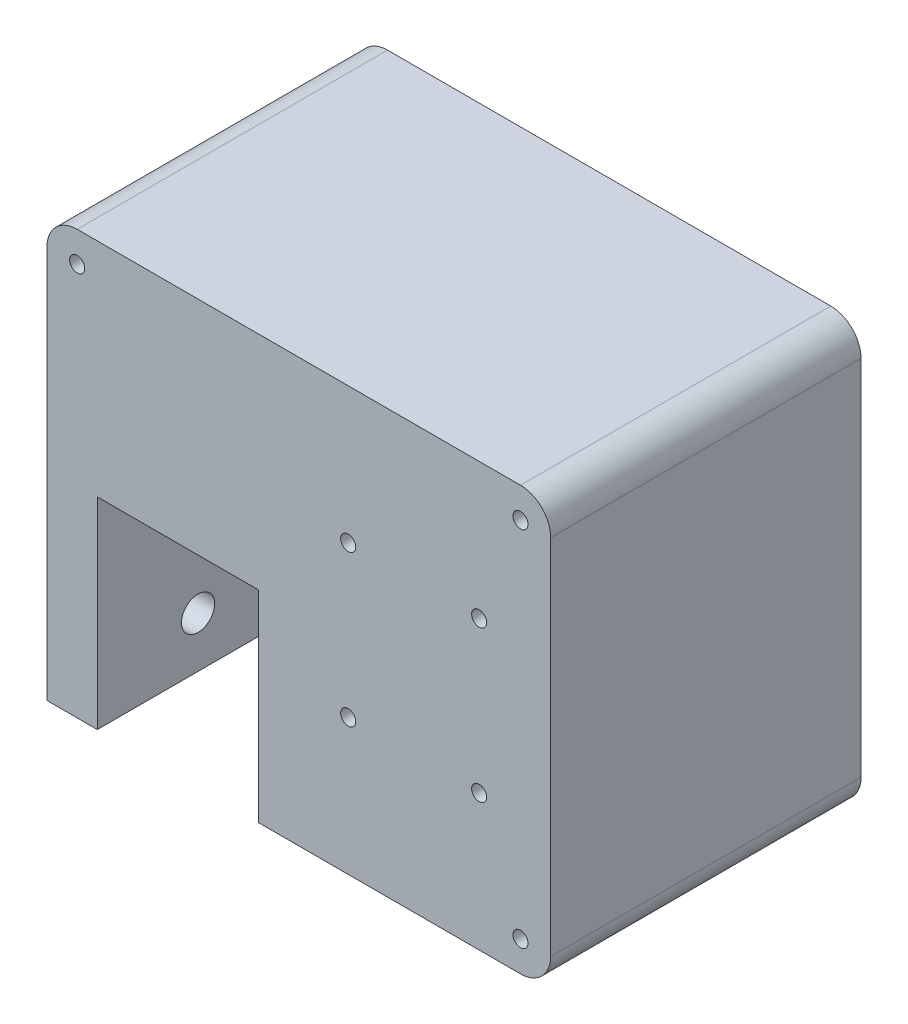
ISO-10303-21;
HEADER;
FILE_DESCRIPTION(('STEP AP214'),'2;1');
FILE_NAME('part.step','',(''),(''),'','','');
FILE_SCHEMA(('AUTOMOTIVE_DESIGN { 1 0 10303 214 1 1 1 1 }'));
ENDSEC;
DATA;
#1=APPLICATION_CONTEXT('core data for automotive mechanical design processes');
#2=APPLICATION_PROTOCOL_DEFINITION('international standard','automotive_design',2000,#1);
#3=PRODUCT_CONTEXT('',#1,'mechanical');
#4=PRODUCT('Part','Part','',(#3));
#5=PRODUCT_RELATED_PRODUCT_CATEGORY('part','',(#4));
#6=PRODUCT_DEFINITION_FORMATION('','',#4);
#7=PRODUCT_DEFINITION_CONTEXT('part definition',#1,'design');
#8=PRODUCT_DEFINITION('design','',#6,#7);
#9=PRODUCT_DEFINITION_SHAPE('','',#8);
#10=(LENGTH_UNIT() NAMED_UNIT(*) SI_UNIT(.MILLI.,.METRE.));
#11=(NAMED_UNIT(*) PLANE_ANGLE_UNIT() SI_UNIT($,.RADIAN.));
#12=(NAMED_UNIT(*) SI_UNIT($,.STERADIAN.) SOLID_ANGLE_UNIT());
#13=UNCERTAINTY_MEASURE_WITH_UNIT(LENGTH_MEASURE(1.E-05),#10,'distance_accuracy_value','');
#14=(GEOMETRIC_REPRESENTATION_CONTEXT(3) GLOBAL_UNCERTAINTY_ASSIGNED_CONTEXT((#13)) GLOBAL_UNIT_ASSIGNED_CONTEXT((#10,
#11,#12)) REPRESENTATION_CONTEXT('',''));
#15=CARTESIAN_POINT('',(0.,0.,0.));
#16=DIRECTION('',(0.,0.,1.));
#17=DIRECTION('',(1.,0.,0.));
#18=AXIS2_PLACEMENT_3D('',#15,#16,#17);
#19=CARTESIAN_POINT('',(-20.,-49.,18.4));
#20=DIRECTION('',(0.,0.,1.));
#21=DIRECTION('',(1.,0.,0.));
#22=AXIS2_PLACEMENT_3D('',#19,#20,#21);
#23=PLANE('',#22);
#24=CARTESIAN_POINT('',(59.7999999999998,2.00000000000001,18.4));
#25=DIRECTION('',(0.,0.,1.));
#26=DIRECTION('',(1.,0.,0.));
#27=AXIS2_PLACEMENT_3D('',#24,#25,#26);
#28=CIRCLE('',#27,7.49999999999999);
#29=CARTESIAN_POINT('',(67.2999999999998,2.00000000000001,18.4));
#30=VERTEX_POINT('',#29);
#31=EDGE_CURVE('E156',#30,#30,#28,.T.);
#32=ORIENTED_EDGE('',*,*,#31,.T.);
#33=EDGE_LOOP('',(#32));
#34=FACE_BOUND('',#33,.T.);
#35=CARTESIAN_POINT('',(33.7999999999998,2.00000000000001,18.4));
#36=DIRECTION('',(0.,0.,1.));
#37=DIRECTION('',(1.,0.,0.));
#38=AXIS2_PLACEMENT_3D('',#35,#36,#37);
#39=CIRCLE('',#38,7.50000000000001);
#40=CARTESIAN_POINT('',(41.2999999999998,2.00000000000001,18.4));
#41=VERTEX_POINT('',#40);
#42=EDGE_CURVE('E153',#41,#41,#39,.T.);
#43=ORIENTED_EDGE('',*,*,#42,.T.);
#44=EDGE_LOOP('',(#43));
#45=FACE_BOUND('',#44,.T.);
#46=CARTESIAN_POINT('',(33.8000000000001,-28.,18.4));
#47=DIRECTION('',(0.,0.,1.));
#48=DIRECTION('',(1.,0.,0.));
#49=AXIS2_PLACEMENT_3D('',#46,#47,#48);
#50=CIRCLE('',#49,7.49999999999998);
#51=CARTESIAN_POINT('',(41.3000000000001,-28.,18.4));
#52=VERTEX_POINT('',#51);
#53=EDGE_CURVE('E150',#52,#52,#50,.T.);
#54=ORIENTED_EDGE('',*,*,#53,.T.);
#55=EDGE_LOOP('',(#54));
#56=FACE_BOUND('',#55,.T.);
#57=CARTESIAN_POINT('',(59.8000000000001,-28.,18.4));
#58=DIRECTION('',(0.,0.,1.));
#59=DIRECTION('',(1.,0.,0.));
#60=AXIS2_PLACEMENT_3D('',#57,#58,#59);
#61=CIRCLE('',#60,7.49999999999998);
#62=CARTESIAN_POINT('',(67.3000000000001,-28.,18.4));
#63=VERTEX_POINT('',#62);
#64=EDGE_CURVE('E147',#63,#63,#61,.T.);
#65=ORIENTED_EDGE('',*,*,#64,.T.);
#66=EDGE_LOOP('',(#65));
#67=FACE_BOUND('',#66,.T.);
#68=DIRECTION('',(-0.707106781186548,-0.707106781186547,0.));
#69=VECTOR('',#68,1.);
#70=CARTESIAN_POINT('',(72.2,-38.2,18.4));
#71=LINE('',#70,#69);
#72=CARTESIAN_POINT('',(72.2,-38.2,18.4));
#73=VERTEX_POINT('',#72);
#74=CARTESIAN_POINT('',(57.2,-53.2,18.4));
#75=VERTEX_POINT('',#74);
#76=EDGE_CURVE('E293',#73,#75,#71,.T.);
#77=ORIENTED_EDGE('',*,*,#76,.T.);
#78=DIRECTION('',(-1.,0.,0.));
#79=VECTOR('',#78,1.);
#80=CARTESIAN_POINT('',(57.2,-53.2,18.4));
#81=LINE('',#80,#79);
#82=CARTESIAN_POINT('',(26.,-53.2,18.4));
#83=VERTEX_POINT('',#82);
#84=EDGE_CURVE('E296',#75,#83,#81,.T.);
#85=ORIENTED_EDGE('',*,*,#84,.T.);
#86=DIRECTION('',(0.,1.,0.));
#87=VECTOR('',#86,1.);
#88=CARTESIAN_POINT('',(26.,-55.,18.4));
#89=LINE('',#88,#87);
#90=CARTESIAN_POINT('',(26.,7.99999999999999,18.4));
#91=VERTEX_POINT('',#90);
#92=EDGE_CURVE('E445',#83,#91,#89,.T.);
#93=ORIENTED_EDGE('',*,*,#92,.T.);
#94=CARTESIAN_POINT('',(16.,7.99999999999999,18.4));
#95=DIRECTION('',(0.,0.,1.));
#96=DIRECTION('',(1.,0.,0.));
#97=AXIS2_PLACEMENT_3D('',#94,#95,#96);
#98=CIRCLE('',#97,10.);
#99=CARTESIAN_POINT('',(16.,18.,18.4));
#100=VERTEX_POINT('',#99);
#101=EDGE_CURVE('E442',#91,#100,#98,.T.);
#102=ORIENTED_EDGE('',*,*,#101,.T.);
#103=DIRECTION('',(-1.,0.,0.));
#104=VECTOR('',#103,1.);
#105=CARTESIAN_POINT('',(16.,18.,18.4));
#106=LINE('',#105,#104);
#107=CARTESIAN_POINT('',(-16.,18.,18.4));
#108=VERTEX_POINT('',#107);
#109=EDGE_CURVE('E439',#100,#108,#106,.T.);
#110=ORIENTED_EDGE('',*,*,#109,.T.);
#111=CARTESIAN_POINT('',(-16.,8.,18.4));
#112=DIRECTION('',(0.,0.,1.));
#113=DIRECTION('',(1.,0.,0.));
#114=AXIS2_PLACEMENT_3D('',#111,#112,#113);
#115=CIRCLE('',#114,10.);
#116=CARTESIAN_POINT('',(-18.8,17.6,18.4));
#117=VERTEX_POINT('',#116);
#118=EDGE_CURVE('E84',#108,#117,#115,.T.);
#119=ORIENTED_EDGE('',*,*,#118,.T.);
#120=DIRECTION('',(0.707106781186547,0.707106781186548,0.));
#121=VECTOR('',#120,1.);
#122=CARTESIAN_POINT('',(-52.7,-16.3,18.4));
#123=LINE('',#122,#121);
#124=CARTESIAN_POINT('',(-9.2,27.2,18.4));
#125=VERTEX_POINT('',#124);
#126=EDGE_CURVE('E132',#117,#125,#123,.T.);
#127=ORIENTED_EDGE('',*,*,#126,.T.);
#128=DIRECTION('',(1.,0.,0.));
#129=VECTOR('',#128,1.);
#130=CARTESIAN_POINT('',(57.2,27.2,18.4));
#131=LINE('',#130,#129);
#132=CARTESIAN_POINT('',(57.2,27.2,18.4));
#133=VERTEX_POINT('',#132);
#134=EDGE_CURVE('E266',#125,#133,#131,.T.);
#135=ORIENTED_EDGE('',*,*,#134,.T.);
#136=DIRECTION('',(0.707106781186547,-0.707106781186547,0.));
#137=VECTOR('',#136,1.);
#138=CARTESIAN_POINT('',(72.2,12.2,18.4));
#139=LINE('',#138,#137);
#140=CARTESIAN_POINT('',(72.2,12.2,18.4));
#141=VERTEX_POINT('',#140);
#142=EDGE_CURVE('E259',#133,#141,#139,.T.);
#143=ORIENTED_EDGE('',*,*,#142,.T.);
#144=DIRECTION('',(0.,-1.,0.));
#145=VECTOR('',#144,1.);
#146=CARTESIAN_POINT('',(72.2,-38.2,18.4));
#147=LINE('',#146,#145);
#148=EDGE_CURVE('E290',#141,#73,#147,.T.);
#149=ORIENTED_EDGE('',*,*,#148,.T.);
#150=EDGE_LOOP('',(#77,#85,#93,#102,#110,#119,#127,#135,#143,#149));
#151=FACE_BOUND('',#150,.T.);
#152=ADVANCED_FACE('F33',(#34,#45,#56,#67,#151),#23,.F.);
#153=CARTESIAN_POINT('',(-16.,-55.,20.));
#154=DIRECTION('',(0.,1.,0.));
#155=DIRECTION('',(0.,0.,1.));
#156=AXIS2_PLACEMENT_3D('',#153,#154,#155);
#157=PLANE('',#156);
#158=CARTESIAN_POINT('',(42.,-55.,9.));
#159=DIRECTION('',(0.,-1.,0.));
#160=DIRECTION('',(0.,0.,-1.));
#161=AXIS2_PLACEMENT_3D('',#158,#159,#160);
#162=CIRCLE('',#161,1.25);
#163=CARTESIAN_POINT('',(42.,-55.,7.75));
#164=VERTEX_POINT('',#163);
#165=EDGE_CURVE('E191',#164,#164,#162,.T.);
#166=ORIENTED_EDGE('',*,*,#165,.F.);
#167=EDGE_LOOP('',(#166));
#168=FACE_BOUND('',#167,.T.);
#169=CARTESIAN_POINT('',(37.,-55.,-15.));
#170=DIRECTION('',(0.,-1.,0.));
#171=DIRECTION('',(0.,0.,-1.));
#172=AXIS2_PLACEMENT_3D('',#169,#170,#171);
#173=CIRCLE('',#172,5.);
#174=CARTESIAN_POINT('',(37.,-55.,-20.));
#175=VERTEX_POINT('',#174);
#176=EDGE_CURVE('E196',#175,#175,#173,.T.);
#177=ORIENTED_EDGE('',*,*,#176,.F.);
#178=EDGE_LOOP('',(#177));
#179=FACE_BOUND('',#178,.T.);
#180=CARTESIAN_POINT('',(32.,-55.,9.));
#181=DIRECTION('',(0.,-1.,0.));
#182=DIRECTION('',(0.,0.,-1.));
#183=AXIS2_PLACEMENT_3D('',#180,#181,#182);
#184=CIRCLE('',#183,1.25);
#185=CARTESIAN_POINT('',(32.,-55.,7.75));
#186=VERTEX_POINT('',#185);
#187=EDGE_CURVE('E188',#186,#186,#184,.T.);
#188=ORIENTED_EDGE('',*,*,#187,.F.);
#189=EDGE_LOOP('',(#188));
#190=FACE_BOUND('',#189,.T.);
#191=DIRECTION('',(1.,0.,0.));
#192=VECTOR('',#191,1.);
#193=CARTESIAN_POINT('',(26.,-55.,20.));
#194=LINE('',#193,#192);
#195=CARTESIAN_POINT('',(16.,-55.,20.));
#196=VERTEX_POINT('',#195);
#197=CARTESIAN_POINT('',(68.,-55.,20.));
#198=VERTEX_POINT('',#197);
#199=EDGE_CURVE('E114',#196,#198,#194,.T.);
#200=ORIENTED_EDGE('',*,*,#199,.F.);
#201=DIRECTION('',(0.,0.,-1.));
#202=VECTOR('',#201,1.);
#203=CARTESIAN_POINT('',(16.,-55.,20.));
#204=LINE('',#203,#202);
#205=CARTESIAN_POINT('',(16.,-55.,-41.6));
#206=VERTEX_POINT('',#205);
#207=EDGE_CURVE('E255',#196,#206,#204,.T.);
#208=ORIENTED_EDGE('',*,*,#207,.T.);
#209=DIRECTION('',(-1.,0.,0.));
#210=VECTOR('',#209,1.);
#211=CARTESIAN_POINT('',(68.,-55.,-41.6));
#212=LINE('',#211,#210);
#213=CARTESIAN_POINT('',(68.,-55.,-41.6));
#214=VERTEX_POINT('',#213);
#215=EDGE_CURVE('E337',#214,#206,#212,.T.);
#216=ORIENTED_EDGE('',*,*,#215,.F.);
#217=DIRECTION('',(0.,0.,1.));
#218=VECTOR('',#217,1.);
#219=CARTESIAN_POINT('',(68.,-55.,18.4));
#220=LINE('',#219,#218);
#221=EDGE_CURVE('E420',#214,#198,#220,.T.);
#222=ORIENTED_EDGE('',*,*,#221,.T.);
#223=EDGE_LOOP('',(#200,#208,#216,#222));
#224=FACE_BOUND('',#223,.T.);
#225=ADVANCED_FACE('F653',(#168,#179,#190,#224),#157,.F.);
#226=CARTESIAN_POINT('',(-9.2,-53.2,-41.6));
#227=DIRECTION('',(0.707106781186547,0.707106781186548,0.));
#228=DIRECTION('',(-0.707106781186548,0.707106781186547,0.));
#229=AXIS2_PLACEMENT_3D('',#226,#227,#228);
#230=PLANE('',#229);
#231=DIRECTION('',(0.,0.,1.));
#232=VECTOR('',#231,1.);
#233=CARTESIAN_POINT('',(-16.,-46.4,-41.6));
#234=LINE('',#233,#232);
#235=CARTESIAN_POINT('',(-16.,-46.4,-41.6));
#236=VERTEX_POINT('',#235);
#237=CARTESIAN_POINT('',(-16.,-46.4,-20.));
#238=VERTEX_POINT('',#237);
#239=EDGE_CURVE('E138',#236,#238,#234,.T.);
#240=ORIENTED_EDGE('',*,*,#239,.F.);
#241=DIRECTION('',(-0.707106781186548,0.707106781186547,0.));
#242=VECTOR('',#241,1.);
#243=CARTESIAN_POINT('',(-9.2,-53.2,-41.6));
#244=LINE('',#243,#242);
#245=CARTESIAN_POINT('',(-24.2,-38.2,-41.6));
#246=VERTEX_POINT('',#245);
#247=EDGE_CURVE('E275',#236,#246,#244,.T.);
#248=ORIENTED_EDGE('',*,*,#247,.T.);
#249=DIRECTION('',(0.,0.,1.));
#250=VECTOR('',#249,1.);
#251=CARTESIAN_POINT('',(-24.2,-38.2,-41.6));
#252=LINE('',#251,#250);
#253=CARTESIAN_POINT('',(-24.2,-38.2,-20.));
#254=VERTEX_POINT('',#253);
#255=EDGE_CURVE('E309',#246,#254,#252,.T.);
#256=ORIENTED_EDGE('',*,*,#255,.T.);
#257=DIRECTION('',(-0.707106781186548,0.707106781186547,0.));
#258=VECTOR('',#257,1.);
#259=CARTESIAN_POINT('',(-27.2,-35.2,-20.));
#260=LINE('',#259,#258);
#261=EDGE_CURVE('E364',#238,#254,#260,.T.);
#262=ORIENTED_EDGE('',*,*,#261,.F.);
#263=EDGE_LOOP('',(#240,#248,#256,#262));
#264=FACE_BOUND('',#263,.T.);
#265=ADVANCED_FACE('F626',(#264),#230,.T.);
#266=CARTESIAN_POINT('',(16.,7.99999999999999,-20.));
#267=DIRECTION('',(0.,0.,1.));
#268=DIRECTION('',(1.,0.,0.));
#269=AXIS2_PLACEMENT_3D('',#266,#267,#268);
#270=PLANE('',#269);
#271=CARTESIAN_POINT('',(-20.,-49.,-20.));
#272=DIRECTION('',(0.,0.,1.));
#273=DIRECTION('',(1.,0.,0.));
#274=AXIS2_PLACEMENT_3D('',#271,#272,#273);
#275=CIRCLE('',#274,6.);
#276=CARTESIAN_POINT('',(-20.,-55.,-20.));
#277=VERTEX_POINT('',#276);
#278=CARTESIAN_POINT('',(-26.,-49.,-20.));
#279=VERTEX_POINT('',#278);
#280=EDGE_CURVE('E381',#277,#279,#275,.F.);
#281=ORIENTED_EDGE('',*,*,#280,.F.);
#282=DIRECTION('',(1.,0.,0.));
#283=VECTOR('',#282,1.);
#284=CARTESIAN_POINT('',(-16.,-55.,-20.));
#285=LINE('',#284,#283);
#286=CARTESIAN_POINT('',(-26.,-55.,-20.));
#287=VERTEX_POINT('',#286);
#288=EDGE_CURVE('E108',#287,#277,#285,.T.);
#289=ORIENTED_EDGE('',*,*,#288,.F.);
#290=DIRECTION('',(0.,-1.,0.));
#291=VECTOR('',#290,1.);
#292=CARTESIAN_POINT('',(-26.,-55.,-20.));
#293=LINE('',#292,#291);
#294=EDGE_CURVE('E106',#279,#287,#293,.T.);
#295=ORIENTED_EDGE('',*,*,#294,.F.);
#296=EDGE_LOOP('',(#281,#289,#295));
#297=FACE_BOUND('',#296,.T.);
#298=ADVANCED_FACE('F677',(#297),#270,.F.);
#299=CARTESIAN_POINT('',(-16.,-55.,20.));
#300=DIRECTION('',(-1.,0.,0.));
#301=DIRECTION('',(0.,-1.,0.));
#302=AXIS2_PLACEMENT_3D('',#299,#300,#301);
#303=PLANE('',#302);
#304=CARTESIAN_POINT('',(-16.,-45.,0.));
#305=DIRECTION('',(-1.,0.,0.));
#306=DIRECTION('',(0.,-1.,0.));
#307=AXIS2_PLACEMENT_3D('',#304,#305,#306);
#308=CIRCLE('',#307,3.3);
#309=CARTESIAN_POINT('',(-16.,-48.3,0.));
#310=VERTEX_POINT('',#309);
#311=EDGE_CURVE('E231',#310,#310,#308,.T.);
#312=ORIENTED_EDGE('',*,*,#311,.T.);
#313=EDGE_LOOP('',(#312));
#314=FACE_BOUND('',#313,.T.);
#315=CARTESIAN_POINT('',(-16.,-25.,0.));
#316=DIRECTION('',(-1.,0.,0.));
#317=DIRECTION('',(0.,-1.,0.));
#318=AXIS2_PLACEMENT_3D('',#315,#316,#317);
#319=CIRCLE('',#318,3.3);
#320=CARTESIAN_POINT('',(-16.,-28.3,0.));
#321=VERTEX_POINT('',#320);
#322=EDGE_CURVE('E237',#321,#321,#319,.T.);
#323=ORIENTED_EDGE('',*,*,#322,.T.);
#324=EDGE_LOOP('',(#323));
#325=FACE_BOUND('',#324,.T.);
#326=DIRECTION('',(0.,0.,-1.));
#327=VECTOR('',#326,1.);
#328=CARTESIAN_POINT('',(-16.,-15.,20.));
#329=LINE('',#328,#327);
#330=CARTESIAN_POINT('',(-16.,-15.,20.));
#331=VERTEX_POINT('',#330);
#332=CARTESIAN_POINT('',(-16.,-15.,-20.));
#333=VERTEX_POINT('',#332);
#334=EDGE_CURVE('E123',#331,#333,#329,.T.);
#335=ORIENTED_EDGE('',*,*,#334,.F.);
#336=DIRECTION('',(0.,1.,0.));
#337=VECTOR('',#336,1.);
#338=CARTESIAN_POINT('',(-16.,-15.,20.));
#339=LINE('',#338,#337);
#340=CARTESIAN_POINT('',(-16.,-55.,20.));
#341=VERTEX_POINT('',#340);
#342=EDGE_CURVE('E249',#341,#331,#339,.T.);
#343=ORIENTED_EDGE('',*,*,#342,.F.);
#344=DIRECTION('',(0.,0.,-1.));
#345=VECTOR('',#344,1.);
#346=CARTESIAN_POINT('',(-16.,-55.,20.));
#347=LINE('',#346,#345);
#348=CARTESIAN_POINT('',(-16.,-55.,-41.6));
#349=VERTEX_POINT('',#348);
#350=EDGE_CURVE('E256',#341,#349,#347,.T.);
#351=ORIENTED_EDGE('',*,*,#350,.T.);
#352=DIRECTION('',(0.,1.,0.));
#353=VECTOR('',#352,1.);
#354=CARTESIAN_POINT('',(-16.,-15.,-41.6));
#355=LINE('',#354,#353);
#356=EDGE_CURVE('E243',#349,#236,#355,.T.);
#357=ORIENTED_EDGE('',*,*,#356,.T.);
#358=ORIENTED_EDGE('',*,*,#239,.T.);
#359=DIRECTION('',(0.,1.,0.));
#360=VECTOR('',#359,1.);
#361=CARTESIAN_POINT('',(-16.,-55.,-20.));
#362=LINE('',#361,#360);
#363=EDGE_CURVE('E472',#238,#333,#362,.T.);
#364=ORIENTED_EDGE('',*,*,#363,.T.);
#365=EDGE_LOOP('',(#335,#343,#351,#357,#358,#364));
#366=FACE_BOUND('',#365,.T.);
#367=ADVANCED_FACE('F631',(#314,#325,#366),#303,.F.);
#368=CARTESIAN_POINT('',(16.,-15.,20.));
#369=DIRECTION('',(0.,1.,0.));
#370=DIRECTION('',(0.,0.,1.));
#371=AXIS2_PLACEMENT_3D('',#368,#369,#370);
#372=PLANE('',#371);
#373=DIRECTION('',(0.,0.,-1.));
#374=VECTOR('',#373,1.);
#375=CARTESIAN_POINT('',(16.,-15.,20.));
#376=LINE('',#375,#374);
#377=CARTESIAN_POINT('',(16.,-15.,20.));
#378=VERTEX_POINT('',#377);
#379=CARTESIAN_POINT('',(16.,-15.,-20.));
#380=VERTEX_POINT('',#379);
#381=EDGE_CURVE('E121',#378,#380,#376,.T.);
#382=ORIENTED_EDGE('',*,*,#381,.F.);
#383=DIRECTION('',(1.,0.,0.));
#384=VECTOR('',#383,1.);
#385=CARTESIAN_POINT('',(16.,-15.,20.));
#386=LINE('',#385,#384);
#387=EDGE_CURVE('E252',#331,#378,#386,.T.);
#388=ORIENTED_EDGE('',*,*,#387,.F.);
#389=ORIENTED_EDGE('',*,*,#334,.T.);
#390=DIRECTION('',(1.,0.,0.));
#391=VECTOR('',#390,1.);
#392=CARTESIAN_POINT('',(16.,-15.,-20.));
#393=LINE('',#392,#391);
#394=EDGE_CURVE('E476',#333,#380,#393,.T.);
#395=ORIENTED_EDGE('',*,*,#394,.T.);
#396=EDGE_LOOP('',(#382,#388,#389,#395));
#397=FACE_BOUND('',#396,.T.);
#398=ADVANCED_FACE('F666',(#397),#372,.F.);
#399=CARTESIAN_POINT('',(16.,-55.,20.));
#400=DIRECTION('',(1.,0.,0.));
#401=DIRECTION('',(0.,1.,0.));
#402=AXIS2_PLACEMENT_3D('',#399,#400,#401);
#403=PLANE('',#402);
#404=CARTESIAN_POINT('',(16.,-45.,0.));
#405=DIRECTION('',(1.,0.,0.));
#406=DIRECTION('',(0.,1.,0.));
#407=AXIS2_PLACEMENT_3D('',#404,#405,#406);
#408=CIRCLE('',#407,3.);
#409=CARTESIAN_POINT('',(16.,-42.,0.));
#410=VERTEX_POINT('',#409);
#411=EDGE_CURVE('E463',#410,#410,#408,.T.);
#412=ORIENTED_EDGE('',*,*,#411,.T.);
#413=EDGE_LOOP('',(#412));
#414=FACE_BOUND('',#413,.T.);
#415=CARTESIAN_POINT('',(16.,-25.,0.));
#416=DIRECTION('',(1.,0.,0.));
#417=DIRECTION('',(0.,1.,0.));
#418=AXIS2_PLACEMENT_3D('',#415,#416,#417);
#419=CIRCLE('',#418,3.);
#420=CARTESIAN_POINT('',(16.,-22.,0.));
#421=VERTEX_POINT('',#420);
#422=EDGE_CURVE('E457',#421,#421,#419,.T.);
#423=ORIENTED_EDGE('',*,*,#422,.T.);
#424=EDGE_LOOP('',(#423));
#425=FACE_BOUND('',#424,.T.);
#426=DIRECTION('',(0.,-1.,0.));
#427=VECTOR('',#426,1.);
#428=CARTESIAN_POINT('',(16.,-55.,-20.));
#429=LINE('',#428,#427);
#430=CARTESIAN_POINT('',(16.,-53.2,-20.));
#431=VERTEX_POINT('',#430);
#432=EDGE_CURVE('E479',#380,#431,#429,.T.);
#433=ORIENTED_EDGE('',*,*,#432,.T.);
#434=DIRECTION('',(0.,0.,-1.));
#435=VECTOR('',#434,1.);
#436=CARTESIAN_POINT('',(16.,-53.2,-41.6));
#437=LINE('',#436,#435);
#438=CARTESIAN_POINT('',(16.,-53.2,-41.6));
#439=VERTEX_POINT('',#438);
#440=EDGE_CURVE('E135',#431,#439,#437,.T.);
#441=ORIENTED_EDGE('',*,*,#440,.T.);
#442=DIRECTION('',(0.,-1.,0.));
#443=VECTOR('',#442,1.);
#444=CARTESIAN_POINT('',(16.,-15.,-41.6));
#445=LINE('',#444,#443);
#446=EDGE_CURVE('E240',#439,#206,#445,.T.);
#447=ORIENTED_EDGE('',*,*,#446,.T.);
#448=ORIENTED_EDGE('',*,*,#207,.F.);
#449=DIRECTION('',(0.,-1.,0.));
#450=VECTOR('',#449,1.);
#451=CARTESIAN_POINT('',(16.,-15.,20.));
#452=LINE('',#451,#450);
#453=EDGE_CURVE('E246',#378,#196,#452,.T.);
#454=ORIENTED_EDGE('',*,*,#453,.F.);
#455=ORIENTED_EDGE('',*,*,#381,.T.);
#456=EDGE_LOOP('',(#433,#441,#447,#448,#454,#455));
#457=FACE_BOUND('',#456,.T.);
#458=ADVANCED_FACE('F648',(#414,#425,#457),#403,.F.);
#459=CARTESIAN_POINT('',(26.,-55.,20.));
#460=DIRECTION('',(-1.,0.,0.));
#461=DIRECTION('',(0.,-1.,0.));
#462=AXIS2_PLACEMENT_3D('',#459,#460,#461);
#463=PLANE('',#462);
#464=CARTESIAN_POINT('',(26.,-45.,0.));
#465=DIRECTION('',(-1.,0.,0.));
#466=DIRECTION('',(0.,-1.,0.));
#467=AXIS2_PLACEMENT_3D('',#464,#465,#466);
#468=CIRCLE('',#467,3.);
#469=CARTESIAN_POINT('',(26.,-48.,0.));
#470=VERTEX_POINT('',#469);
#471=EDGE_CURVE('E460',#470,#470,#468,.T.);
#472=ORIENTED_EDGE('',*,*,#471,.T.);
#473=EDGE_LOOP('',(#472));
#474=FACE_BOUND('',#473,.T.);
#475=CARTESIAN_POINT('',(26.,-25.,0.));
#476=DIRECTION('',(-1.,0.,0.));
#477=DIRECTION('',(0.,-1.,0.));
#478=AXIS2_PLACEMENT_3D('',#475,#476,#477);
#479=CIRCLE('',#478,3.);
#480=CARTESIAN_POINT('',(26.,-28.,0.));
#481=VERTEX_POINT('',#480);
#482=EDGE_CURVE('E454',#481,#481,#479,.T.);
#483=ORIENTED_EDGE('',*,*,#482,.T.);
#484=EDGE_LOOP('',(#483));
#485=FACE_BOUND('',#484,.T.);
#486=ORIENTED_EDGE('',*,*,#92,.F.);
#487=DIRECTION('',(0.,0.,-1.));
#488=VECTOR('',#487,1.);
#489=CARTESIAN_POINT('',(26.,-53.2,20.));
#490=LINE('',#489,#488);
#491=CARTESIAN_POINT('',(26.,-53.2,-20.));
#492=VERTEX_POINT('',#491);
#493=EDGE_CURVE('E370',#83,#492,#490,.T.);
#494=ORIENTED_EDGE('',*,*,#493,.T.);
#495=DIRECTION('',(0.,1.,0.));
#496=VECTOR('',#495,1.);
#497=CARTESIAN_POINT('',(26.,-55.,-20.));
#498=LINE('',#497,#496);
#499=CARTESIAN_POINT('',(26.,7.99999999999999,-20.));
#500=VERTEX_POINT('',#499);
#501=EDGE_CURVE('E482',#492,#500,#498,.T.);
#502=ORIENTED_EDGE('',*,*,#501,.T.);
#503=DIRECTION('',(0.,0.,-1.));
#504=VECTOR('',#503,1.);
#505=CARTESIAN_POINT('',(26.,7.99999999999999,20.));
#506=LINE('',#505,#504);
#507=EDGE_CURVE('E118',#91,#500,#506,.T.);
#508=ORIENTED_EDGE('',*,*,#507,.F.);
#509=EDGE_LOOP('',(#486,#494,#502,#508));
#510=FACE_BOUND('',#509,.T.);
#511=ADVANCED_FACE('F496',(#474,#485,#510),#463,.F.);
#512=CARTESIAN_POINT('',(16.,7.99999999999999,20.));
#513=DIRECTION('',(0.,0.,-1.));
#514=DIRECTION('',(-1.,0.,0.));
#515=AXIS2_PLACEMENT_3D('',#512,#513,#514);
#516=CYLINDRICAL_SURFACE('',#515,10.);
#517=ORIENTED_EDGE('',*,*,#101,.F.);
#518=ORIENTED_EDGE('',*,*,#507,.T.);
#519=CARTESIAN_POINT('',(16.,7.99999999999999,-20.));
#520=DIRECTION('',(0.,0.,1.));
#521=DIRECTION('',(1.,0.,0.));
#522=AXIS2_PLACEMENT_3D('',#519,#520,#521);
#523=CIRCLE('',#522,10.);
#524=CARTESIAN_POINT('',(16.,18.,-20.));
#525=VERTEX_POINT('',#524);
#526=EDGE_CURVE('E97',#500,#525,#523,.T.);
#527=ORIENTED_EDGE('',*,*,#526,.T.);
#528=DIRECTION('',(0.,0.,-1.));
#529=VECTOR('',#528,1.);
#530=CARTESIAN_POINT('',(16.,18.,20.));
#531=LINE('',#530,#529);
#532=EDGE_CURVE('E87',#100,#525,#531,.T.);
#533=ORIENTED_EDGE('',*,*,#532,.F.);
#534=EDGE_LOOP('',(#517,#518,#527,#533));
#535=FACE_BOUND('',#534,.T.);
#536=ADVANCED_FACE('F485',(#535),#516,.T.);
#537=CARTESIAN_POINT('',(16.,18.,20.));
#538=DIRECTION('',(0.,-1.,0.));
#539=DIRECTION('',(1.,0.,0.));
#540=AXIS2_PLACEMENT_3D('',#537,#538,#539);
#541=PLANE('',#540);
#542=ORIENTED_EDGE('',*,*,#109,.F.);
#543=ORIENTED_EDGE('',*,*,#532,.T.);
#544=DIRECTION('',(-1.,0.,0.));
#545=VECTOR('',#544,1.);
#546=CARTESIAN_POINT('',(16.,18.,-20.));
#547=LINE('',#546,#545);
#548=CARTESIAN_POINT('',(-16.,18.,-20.));
#549=VERTEX_POINT('',#548);
#550=EDGE_CURVE('E91',#525,#549,#547,.T.);
#551=ORIENTED_EDGE('',*,*,#550,.T.);
#552=DIRECTION('',(0.,0.,-1.));
#553=VECTOR('',#552,1.);
#554=CARTESIAN_POINT('',(-16.,18.,20.));
#555=LINE('',#554,#553);
#556=EDGE_CURVE('E75',#108,#549,#555,.T.);
#557=ORIENTED_EDGE('',*,*,#556,.F.);
#558=EDGE_LOOP('',(#542,#543,#551,#557));
#559=FACE_BOUND('',#558,.T.);
#560=ADVANCED_FACE('F92',(#559),#541,.F.);
#561=CARTESIAN_POINT('',(-16.,8.,20.));
#562=DIRECTION('',(0.,0.,-1.));
#563=DIRECTION('',(-1.,0.,0.));
#564=AXIS2_PLACEMENT_3D('',#561,#562,#563);
#565=CYLINDRICAL_SURFACE('',#564,10.);
#566=CARTESIAN_POINT('',(-16.,8.,-20.));
#567=DIRECTION('',(0.,0.,1.));
#568=DIRECTION('',(1.,0.,0.));
#569=AXIS2_PLACEMENT_3D('',#566,#567,#568);
#570=CIRCLE('',#569,10.);
#571=CARTESIAN_POINT('',(-18.8,17.6,-20.));
#572=VERTEX_POINT('',#571);
#573=EDGE_CURVE('E81',#549,#572,#570,.T.);
#574=ORIENTED_EDGE('',*,*,#573,.T.);
#575=DIRECTION('',(0.,0.,-1.));
#576=VECTOR('',#575,1.);
#577=CARTESIAN_POINT('',(-18.8,17.6,20.));
#578=LINE('',#577,#576);
#579=EDGE_CURVE('E374',#572,#117,#578,.F.);
#580=ORIENTED_EDGE('',*,*,#579,.T.);
#581=ORIENTED_EDGE('',*,*,#118,.F.);
#582=ORIENTED_EDGE('',*,*,#556,.T.);
#583=EDGE_LOOP('',(#574,#580,#581,#582));
#584=FACE_BOUND('',#583,.T.);
#585=ADVANCED_FACE('F77',(#584),#565,.T.);
#586=CARTESIAN_POINT('',(0.,0.,14.));
#587=DIRECTION('',(0.,0.,1.));
#588=DIRECTION('',(1.,0.,0.));
#589=AXIS2_PLACEMENT_3D('',#586,#587,#588);
#590=CYLINDRICAL_SURFACE('',#589,6.);
#591=CARTESIAN_POINT('',(0.,0.,14.));
#592=DIRECTION('',(0.,0.,1.));
#593=DIRECTION('',(1.,0.,0.));
#594=AXIS2_PLACEMENT_3D('',#591,#592,#593);
#595=CIRCLE('',#594,6.);
#596=CARTESIAN_POINT('',(6.,0.,14.));
#597=VERTEX_POINT('',#596);
#598=EDGE_CURVE('E466',#597,#597,#595,.T.);
#599=ORIENTED_EDGE('',*,*,#598,.F.);
#600=EDGE_LOOP('',(#599));
#601=FACE_BOUND('',#600,.T.);
#602=CARTESIAN_POINT('',(0.,0.,18.4));
#603=DIRECTION('',(0.,0.,1.));
#604=DIRECTION('',(1.,0.,0.));
#605=AXIS2_PLACEMENT_3D('',#602,#603,#604);
#606=CIRCLE('',#605,6.);
#607=CARTESIAN_POINT('',(6.,0.,18.4));
#608=VERTEX_POINT('',#607);
#609=EDGE_CURVE('E129',#608,#608,#606,.F.);
#610=ORIENTED_EDGE('',*,*,#609,.F.);
#611=EDGE_LOOP('',(#610));
#612=FACE_BOUND('',#611,.T.);
#613=ADVANCED_FACE('F733',(#601,#612),#590,.F.);
#614=CARTESIAN_POINT('',(0.,0.,20.));
#615=DIRECTION('',(0.,0.,-1.));
#616=DIRECTION('',(-1.,0.,0.));
#617=AXIS2_PLACEMENT_3D('',#614,#615,#616);
#618=CYLINDRICAL_SURFACE('',#617,12.);
#619=CARTESIAN_POINT('',(0.,0.,9.));
#620=DIRECTION('',(0.,0.,-1.));
#621=DIRECTION('',(-1.,0.,0.));
#622=AXIS2_PLACEMENT_3D('',#619,#620,#621);
#623=CIRCLE('',#622,12.);
#624=CARTESIAN_POINT('',(-12.,0.,9.));
#625=VERTEX_POINT('',#624);
#626=EDGE_CURVE('E126',#625,#625,#623,.T.);
#627=ORIENTED_EDGE('',*,*,#626,.F.);
#628=EDGE_LOOP('',(#627));
#629=FACE_BOUND('',#628,.T.);
#630=CARTESIAN_POINT('',(0.,0.,-20.));
#631=DIRECTION('',(0.,0.,1.));
#632=DIRECTION('',(1.,0.,0.));
#633=AXIS2_PLACEMENT_3D('',#630,#631,#632);
#634=CIRCLE('',#633,12.);
#635=CARTESIAN_POINT('',(12.,0.,-20.));
#636=VERTEX_POINT('',#635);
#637=EDGE_CURVE('E469',#636,#636,#634,.T.);
#638=ORIENTED_EDGE('',*,*,#637,.F.);
#639=EDGE_LOOP('',(#638));
#640=FACE_BOUND('',#639,.T.);
#641=ADVANCED_FACE('F735',(#629,#640),#618,.F.);
#642=CARTESIAN_POINT('',(16.,7.99999999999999,20.));
#643=DIRECTION('',(0.,0.,1.));
#644=DIRECTION('',(1.,0.,0.));
#645=AXIS2_PLACEMENT_3D('',#642,#643,#644);
#646=PLANE('',#645);
#647=ORIENTED_EDGE('',*,*,#453,.T.);
#648=ORIENTED_EDGE('',*,*,#199,.T.);
#649=CARTESIAN_POINT('',(68.,-49.,20.));
#650=DIRECTION('',(0.,0.,1.));
#651=DIRECTION('',(1.,0.,0.));
#652=AXIS2_PLACEMENT_3D('',#649,#650,#651);
#653=CIRCLE('',#652,5.99999999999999);
#654=CARTESIAN_POINT('',(74.,-49.,20.));
#655=VERTEX_POINT('',#654);
#656=EDGE_CURVE('E405',#198,#655,#653,.T.);
#657=ORIENTED_EDGE('',*,*,#656,.T.);
#658=DIRECTION('',(0.,1.,0.));
#659=VECTOR('',#658,1.);
#660=CARTESIAN_POINT('',(74.,-49.,20.));
#661=LINE('',#660,#659);
#662=CARTESIAN_POINT('',(74.,23.,20.));
#663=VERTEX_POINT('',#662);
#664=EDGE_CURVE('E408',#655,#663,#661,.T.);
#665=ORIENTED_EDGE('',*,*,#664,.T.);
#666=CARTESIAN_POINT('',(68.,23.,20.));
#667=DIRECTION('',(0.,0.,1.));
#668=DIRECTION('',(1.,0.,0.));
#669=AXIS2_PLACEMENT_3D('',#666,#667,#668);
#670=CIRCLE('',#669,6.);
#671=CARTESIAN_POINT('',(68.,29.,20.));
#672=VERTEX_POINT('',#671);
#673=EDGE_CURVE('E411',#663,#672,#670,.T.);
#674=ORIENTED_EDGE('',*,*,#673,.T.);
#675=DIRECTION('',(-1.,0.,0.));
#676=VECTOR('',#675,1.);
#677=CARTESIAN_POINT('',(-20.,29.,20.));
#678=LINE('',#677,#676);
#679=CARTESIAN_POINT('',(-20.,29.,20.));
#680=VERTEX_POINT('',#679);
#681=EDGE_CURVE('E414',#672,#680,#678,.T.);
#682=ORIENTED_EDGE('',*,*,#681,.T.);
#683=CARTESIAN_POINT('',(-20.,23.,20.));
#684=DIRECTION('',(0.,0.,1.));
#685=DIRECTION('',(1.,0.,0.));
#686=AXIS2_PLACEMENT_3D('',#683,#684,#685);
#687=CIRCLE('',#686,5.99999999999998);
#688=CARTESIAN_POINT('',(-26.,23.,20.));
#689=VERTEX_POINT('',#688);
#690=EDGE_CURVE('E417',#680,#689,#687,.T.);
#691=ORIENTED_EDGE('',*,*,#690,.T.);
#692=DIRECTION('',(0.,-1.,0.));
#693=VECTOR('',#692,1.);
#694=CARTESIAN_POINT('',(-26.,-55.,20.));
#695=LINE('',#694,#693);
#696=CARTESIAN_POINT('',(-26.,-55.,20.));
#697=VERTEX_POINT('',#696);
#698=EDGE_CURVE('E115',#689,#697,#695,.T.);
#699=ORIENTED_EDGE('',*,*,#698,.T.);
#700=EDGE_CURVE('E51',#697,#341,#194,.T.);
#701=ORIENTED_EDGE('',*,*,#700,.T.);
#702=ORIENTED_EDGE('',*,*,#342,.T.);
#703=ORIENTED_EDGE('',*,*,#387,.T.);
#704=EDGE_LOOP('',(#647,#648,#657,#665,#674,#682,#691,#699,#701,#702,#703));
#705=FACE_BOUND('',#704,.T.);
#706=CARTESIAN_POINT('',(33.7999999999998,2.00000000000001,20.));
#707=DIRECTION('',(0.,0.,1.));
#708=DIRECTION('',(1.,0.,0.));
#709=AXIS2_PLACEMENT_3D('',#706,#707,#708);
#710=CIRCLE('',#709,1.5);
#711=CARTESIAN_POINT('',(35.2999999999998,2.00000000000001,20.));
#712=VERTEX_POINT('',#711);
#713=EDGE_CURVE('E402',#712,#712,#710,.T.);
#714=ORIENTED_EDGE('',*,*,#713,.F.);
#715=EDGE_LOOP('',(#714));
#716=FACE_BOUND('',#715,.T.);
#717=CARTESIAN_POINT('',(59.7999999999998,2.00000000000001,20.));
#718=DIRECTION('',(0.,0.,1.));
#719=DIRECTION('',(1.,0.,0.));
#720=AXIS2_PLACEMENT_3D('',#717,#718,#719);
#721=CIRCLE('',#720,1.5);
#722=CARTESIAN_POINT('',(61.2999999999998,2.00000000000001,20.));
#723=VERTEX_POINT('',#722);
#724=EDGE_CURVE('E399',#723,#723,#721,.T.);
#725=ORIENTED_EDGE('',*,*,#724,.F.);
#726=EDGE_LOOP('',(#725));
#727=FACE_BOUND('',#726,.T.);
#728=CARTESIAN_POINT('',(59.8000000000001,-28.,20.));
#729=DIRECTION('',(0.,0.,1.));
#730=DIRECTION('',(1.,0.,0.));
#731=AXIS2_PLACEMENT_3D('',#728,#729,#730);
#732=CIRCLE('',#731,1.5);
#733=CARTESIAN_POINT('',(61.3000000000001,-28.,20.));
#734=VERTEX_POINT('',#733);
#735=EDGE_CURVE('E396',#734,#734,#732,.T.);
#736=ORIENTED_EDGE('',*,*,#735,.F.);
#737=EDGE_LOOP('',(#736));
#738=FACE_BOUND('',#737,.T.);
#739=CARTESIAN_POINT('',(33.8000000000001,-28.,20.));
#740=DIRECTION('',(0.,0.,1.));
#741=DIRECTION('',(1.,0.,0.));
#742=AXIS2_PLACEMENT_3D('',#739,#740,#741);
#743=CIRCLE('',#742,1.5);
#744=CARTESIAN_POINT('',(35.3000000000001,-28.,20.));
#745=VERTEX_POINT('',#744);
#746=EDGE_CURVE('E393',#745,#745,#743,.T.);
#747=ORIENTED_EDGE('',*,*,#746,.F.);
#748=EDGE_LOOP('',(#747));
#749=FACE_BOUND('',#748,.T.);
#750=CARTESIAN_POINT('',(-20.,23.,20.));
#751=DIRECTION('',(0.,0.,1.));
#752=DIRECTION('',(1.,0.,0.));
#753=AXIS2_PLACEMENT_3D('',#750,#751,#752);
#754=CIRCLE('',#753,1.5);
#755=CARTESIAN_POINT('',(-18.5,23.,20.));
#756=VERTEX_POINT('',#755);
#757=EDGE_CURVE('E390',#756,#756,#754,.T.);
#758=ORIENTED_EDGE('',*,*,#757,.F.);
#759=EDGE_LOOP('',(#758));
#760=FACE_BOUND('',#759,.T.);
#761=CARTESIAN_POINT('',(67.9999999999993,23.,20.));
#762=DIRECTION('',(0.,0.,1.));
#763=DIRECTION('',(1.,0.,0.));
#764=AXIS2_PLACEMENT_3D('',#761,#762,#763);
#765=CIRCLE('',#764,1.5);
#766=CARTESIAN_POINT('',(69.4999999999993,23.,20.));
#767=VERTEX_POINT('',#766);
#768=EDGE_CURVE('E387',#767,#767,#765,.T.);
#769=ORIENTED_EDGE('',*,*,#768,.F.);
#770=EDGE_LOOP('',(#769));
#771=FACE_BOUND('',#770,.T.);
#772=CARTESIAN_POINT('',(68.,-49.,20.));
#773=DIRECTION('',(0.,0.,1.));
#774=DIRECTION('',(1.,0.,0.));
#775=AXIS2_PLACEMENT_3D('',#772,#773,#774);
#776=CIRCLE('',#775,1.5);
#777=CARTESIAN_POINT('',(69.5,-49.,20.));
#778=VERTEX_POINT('',#777);
#779=EDGE_CURVE('E384',#778,#778,#776,.T.);
#780=ORIENTED_EDGE('',*,*,#779,.F.);
#781=EDGE_LOOP('',(#780));
#782=FACE_BOUND('',#781,.T.);
#783=ADVANCED_FACE('F661',(#705,#716,#727,#738,#749,#760,#771,#782),#646,.T.);
#784=CARTESIAN_POINT('',(-17.5,8.,-20.));
#785=DIRECTION('',(0.,0.,-1.));
#786=DIRECTION('',(-1.,0.,0.));
#787=AXIS2_PLACEMENT_3D('',#784,#785,#786);
#788=CIRCLE('',#787,1.45);
#789=CARTESIAN_POINT('',(-18.95,8.,-20.));
#790=VERTEX_POINT('',#789);
#791=EDGE_CURVE('E187',#790,#790,#788,.T.);
#792=ORIENTED_EDGE('',*,*,#791,.F.);
#793=EDGE_LOOP('',(#792));
#794=FACE_BOUND('',#793,.T.);
#795=CARTESIAN_POINT('',(17.5,8.,-20.));
#796=DIRECTION('',(0.,0.,-1.));
#797=DIRECTION('',(-1.,0.,0.));
#798=AXIS2_PLACEMENT_3D('',#795,#796,#797);
#799=CIRCLE('',#798,1.45);
#800=CARTESIAN_POINT('',(16.05,8.,-20.));
#801=VERTEX_POINT('',#800);
#802=EDGE_CURVE('E208',#801,#801,#799,.T.);
#803=ORIENTED_EDGE('',*,*,#802,.F.);
#804=EDGE_LOOP('',(#803));
#805=FACE_BOUND('',#804,.T.);
#806=ORIENTED_EDGE('',*,*,#501,.F.);
#807=DIRECTION('',(-1.,0.,0.));
#808=VECTOR('',#807,1.);
#809=CARTESIAN_POINT('',(16.,-53.2,-20.));
#810=LINE('',#809,#808);
#811=EDGE_CURVE('E367',#492,#431,#810,.T.);
#812=ORIENTED_EDGE('',*,*,#811,.T.);
#813=ORIENTED_EDGE('',*,*,#432,.F.);
#814=ORIENTED_EDGE('',*,*,#394,.F.);
#815=ORIENTED_EDGE('',*,*,#363,.F.);
#816=ORIENTED_EDGE('',*,*,#261,.T.);
#817=DIRECTION('',(0.,1.,0.));
#818=VECTOR('',#817,1.);
#819=CARTESIAN_POINT('',(-24.2,7.99999999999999,-20.));
#820=LINE('',#819,#818);
#821=CARTESIAN_POINT('',(-24.2,12.2,-20.));
#822=VERTEX_POINT('',#821);
#823=EDGE_CURVE('E376',#254,#822,#820,.T.);
#824=ORIENTED_EDGE('',*,*,#823,.T.);
#825=DIRECTION('',(0.707106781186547,0.707106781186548,0.));
#826=VECTOR('',#825,1.);
#827=CARTESIAN_POINT('',(-6.20000000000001,30.2,-20.));
#828=LINE('',#827,#826);
#829=EDGE_CURVE('E105',#822,#572,#828,.T.);
#830=ORIENTED_EDGE('',*,*,#829,.T.);
#831=ORIENTED_EDGE('',*,*,#573,.F.);
#832=ORIENTED_EDGE('',*,*,#550,.F.);
#833=ORIENTED_EDGE('',*,*,#526,.F.);
#834=EDGE_LOOP('',(#806,#812,#813,#814,#815,#816,#824,#830,#831,#832,#833));
#835=FACE_BOUND('',#834,.T.);
#836=ORIENTED_EDGE('',*,*,#637,.T.);
#837=EDGE_LOOP('',(#836));
#838=FACE_BOUND('',#837,.T.);
#839=ADVANCED_FACE('F101',(#794,#805,#835,#838),#270,.F.);
#840=CARTESIAN_POINT('',(-26.,-55.,20.));
#841=DIRECTION('',(1.,0.,0.));
#842=DIRECTION('',(0.,0.,-1.));
#843=AXIS2_PLACEMENT_3D('',#840,#841,#842);
#844=PLANE('',#843);
#845=CARTESIAN_POINT('',(-26.,-45.,0.));
#846=DIRECTION('',(-1.,0.,0.));
#847=DIRECTION('',(0.,0.,1.));
#848=AXIS2_PLACEMENT_3D('',#845,#846,#847);
#849=CIRCLE('',#848,3.3);
#850=CARTESIAN_POINT('',(-26.,-45.,3.3));
#851=VERTEX_POINT('',#850);
#852=EDGE_CURVE('E228',#851,#851,#849,.T.);
#853=ORIENTED_EDGE('',*,*,#852,.F.);
#854=EDGE_LOOP('',(#853));
#855=FACE_BOUND('',#854,.T.);
#856=CARTESIAN_POINT('',(-26.,-25.,0.));
#857=DIRECTION('',(-1.,0.,0.));
#858=DIRECTION('',(0.,0.,1.));
#859=AXIS2_PLACEMENT_3D('',#856,#857,#858);
#860=CIRCLE('',#859,3.3);
#861=CARTESIAN_POINT('',(-26.,-25.,3.30000000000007));
#862=VERTEX_POINT('',#861);
#863=EDGE_CURVE('E234',#862,#862,#860,.T.);
#864=ORIENTED_EDGE('',*,*,#863,.F.);
#865=EDGE_LOOP('',(#864));
#866=FACE_BOUND('',#865,.T.);
#867=DIRECTION('',(0.,0.,1.));
#868=VECTOR('',#867,1.);
#869=CARTESIAN_POINT('',(-26.,-49.,-41.6));
#870=LINE('',#869,#868);
#871=CARTESIAN_POINT('',(-26.,-49.,-41.6));
#872=VERTEX_POINT('',#871);
#873=EDGE_CURVE('E358',#872,#279,#870,.T.);
#874=ORIENTED_EDGE('',*,*,#873,.T.);
#875=ORIENTED_EDGE('',*,*,#294,.T.);
#876=DIRECTION('',(0.,0.,-1.));
#877=VECTOR('',#876,1.);
#878=CARTESIAN_POINT('',(-26.,-55.,20.));
#879=LINE('',#878,#877);
#880=EDGE_CURVE('E88',#697,#287,#879,.T.);
#881=ORIENTED_EDGE('',*,*,#880,.F.);
#882=ORIENTED_EDGE('',*,*,#698,.F.);
#883=DIRECTION('',(0.,0.,1.));
#884=VECTOR('',#883,1.);
#885=CARTESIAN_POINT('',(-26.,23.,18.4));
#886=LINE('',#885,#884);
#887=CARTESIAN_POINT('',(-26.,23.,-41.6));
#888=VERTEX_POINT('',#887);
#889=EDGE_CURVE('E421',#888,#689,#886,.T.);
#890=ORIENTED_EDGE('',*,*,#889,.F.);
#891=DIRECTION('',(0.,1.,0.));
#892=VECTOR('',#891,1.);
#893=CARTESIAN_POINT('',(-26.,-49.,-41.6));
#894=LINE('',#893,#892);
#895=EDGE_CURVE('E343',#872,#888,#894,.T.);
#896=ORIENTED_EDGE('',*,*,#895,.F.);
#897=EDGE_LOOP('',(#874,#875,#881,#882,#890,#896));
#898=FACE_BOUND('',#897,.T.);
#899=ADVANCED_FACE('F672',(#855,#866,#898),#844,.F.);
#900=CARTESIAN_POINT('',(-20.,-55.,-41.6));
#901=VERTEX_POINT('',#900);
#902=EDGE_CURVE('E336',#349,#901,#212,.T.);
#903=ORIENTED_EDGE('',*,*,#902,.F.);
#904=ORIENTED_EDGE('',*,*,#350,.F.);
#905=ORIENTED_EDGE('',*,*,#700,.F.);
#906=ORIENTED_EDGE('',*,*,#880,.T.);
#907=ORIENTED_EDGE('',*,*,#288,.T.);
#908=DIRECTION('',(0.,0.,1.));
#909=VECTOR('',#908,1.);
#910=CARTESIAN_POINT('',(-20.,-55.,-41.6));
#911=LINE('',#910,#909);
#912=EDGE_CURVE('E361',#901,#277,#911,.T.);
#913=ORIENTED_EDGE('',*,*,#912,.F.);
#914=EDGE_LOOP('',(#903,#904,#905,#906,#907,#913));
#915=FACE_BOUND('',#914,.T.);
#916=ADVANCED_FACE('F667',(#915),#157,.F.);
#917=CARTESIAN_POINT('',(0.,0.,14.));
#918=DIRECTION('',(0.,0.,1.));
#919=DIRECTION('',(1.,0.,0.));
#920=AXIS2_PLACEMENT_3D('',#917,#918,#919);
#921=PLANE('',#920);
#922=CARTESIAN_POINT('',(0.,0.,14.));
#923=DIRECTION('',(0.,0.,-1.));
#924=DIRECTION('',(-1.,0.,0.));
#925=AXIS2_PLACEMENT_3D('',#922,#923,#924);
#926=CIRCLE('',#925,8.8);
#927=CARTESIAN_POINT('',(-8.8,0.,14.));
#928=VERTEX_POINT('',#927);
#929=EDGE_CURVE('E451',#928,#928,#926,.T.);
#930=ORIENTED_EDGE('',*,*,#929,.T.);
#931=EDGE_LOOP('',(#930));
#932=FACE_BOUND('',#931,.T.);
#933=ORIENTED_EDGE('',*,*,#598,.T.);
#934=EDGE_LOOP('',(#933));
#935=FACE_BOUND('',#934,.T.);
#936=ADVANCED_FACE('F750',(#932,#935),#921,.F.);
#937=CARTESIAN_POINT('',(-26.,-45.,0.));
#938=DIRECTION('',(1.,0.,0.));
#939=DIRECTION('',(0.,1.,0.));
#940=AXIS2_PLACEMENT_3D('',#937,#938,#939);
#941=CYLINDRICAL_SURFACE('',#940,3.);
#942=ORIENTED_EDGE('',*,*,#471,.F.);
#943=EDGE_LOOP('',(#942));
#944=FACE_BOUND('',#943,.T.);
#945=ORIENTED_EDGE('',*,*,#411,.F.);
#946=EDGE_LOOP('',(#945));
#947=FACE_BOUND('',#946,.T.);
#948=ADVANCED_FACE('F748',(#944,#947),#941,.F.);
#949=CARTESIAN_POINT('',(-26.,-25.,0.));
#950=DIRECTION('',(1.,0.,0.));
#951=DIRECTION('',(0.,1.,0.));
#952=AXIS2_PLACEMENT_3D('',#949,#950,#951);
#953=CYLINDRICAL_SURFACE('',#952,3.);
#954=ORIENTED_EDGE('',*,*,#482,.F.);
#955=EDGE_LOOP('',(#954));
#956=FACE_BOUND('',#955,.T.);
#957=ORIENTED_EDGE('',*,*,#422,.F.);
#958=EDGE_LOOP('',(#957));
#959=FACE_BOUND('',#958,.T.);
#960=ADVANCED_FACE('F1389',(#956,#959),#953,.F.);
#961=CARTESIAN_POINT('',(0.,0.,0.));
#962=DIRECTION('',(0.,0.,-1.));
#963=DIRECTION('',(-1.,0.,0.));
#964=AXIS2_PLACEMENT_3D('',#961,#962,#963);
#965=CYLINDRICAL_SURFACE('',#964,8.8);
#966=CARTESIAN_POINT('',(0.,0.,9.));
#967=DIRECTION('',(0.,0.,-1.));
#968=DIRECTION('',(-1.,0.,0.));
#969=AXIS2_PLACEMENT_3D('',#966,#967,#968);
#970=CIRCLE('',#969,8.8);
#971=CARTESIAN_POINT('',(-8.8,0.,9.));
#972=VERTEX_POINT('',#971);
#973=EDGE_CURVE('E448',#972,#972,#970,.T.);
#974=ORIENTED_EDGE('',*,*,#973,.T.);
#975=EDGE_LOOP('',(#974));
#976=FACE_BOUND('',#975,.T.);
#977=ORIENTED_EDGE('',*,*,#929,.F.);
#978=EDGE_LOOP('',(#977));
#979=FACE_BOUND('',#978,.T.);
#980=ADVANCED_FACE('F728',(#976,#979),#965,.F.);
#981=CARTESIAN_POINT('',(0.,12.,9.));
#982=DIRECTION('',(0.,0.,-1.));
#983=DIRECTION('',(-1.,0.,0.));
#984=AXIS2_PLACEMENT_3D('',#981,#982,#983);
#985=PLANE('',#984);
#986=ORIENTED_EDGE('',*,*,#626,.T.);
#987=EDGE_LOOP('',(#986));
#988=FACE_BOUND('',#987,.T.);
#989=ORIENTED_EDGE('',*,*,#973,.F.);
#990=EDGE_LOOP('',(#989));
#991=FACE_BOUND('',#990,.T.);
#992=ADVANCED_FACE('F719',(#988,#991),#985,.T.);
#993=ORIENTED_EDGE('',*,*,#609,.T.);
#994=EDGE_LOOP('',(#993));
#995=FACE_BOUND('',#994,.T.);
#996=ADVANCED_FACE('F708',(#995),#23,.F.);
#997=CARTESIAN_POINT('',(68.,-49.,18.4));
#998=DIRECTION('',(0.,0.,1.));
#999=DIRECTION('',(1.,0.,0.));
#1000=AXIS2_PLACEMENT_3D('',#997,#998,#999);
#1001=CYLINDRICAL_SURFACE('',#1000,1.5);
#1002=ORIENTED_EDGE('',*,*,#779,.T.);
#1003=EDGE_LOOP('',(#1002));
#1004=FACE_BOUND('',#1003,.T.);
#1005=CARTESIAN_POINT('',(68.,-49.,-41.6));
#1006=DIRECTION('',(0.,0.,-1.));
#1007=DIRECTION('',(-1.,0.,0.));
#1008=AXIS2_PLACEMENT_3D('',#1005,#1006,#1007);
#1009=CIRCLE('',#1008,1.5);
#1010=CARTESIAN_POINT('',(66.5,-49.,-41.6));
#1011=VERTEX_POINT('',#1010);
#1012=EDGE_CURVE('E330',#1011,#1011,#1009,.T.);
#1013=ORIENTED_EDGE('',*,*,#1012,.T.);
#1014=EDGE_LOOP('',(#1013));
#1015=FACE_BOUND('',#1014,.T.);
#1016=ADVANCED_FACE('F718',(#1004,#1015),#1001,.F.);
#1017=CARTESIAN_POINT('',(67.9999999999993,23.,18.4));
#1018=DIRECTION('',(0.,0.,1.));
#1019=DIRECTION('',(1.,0.,0.));
#1020=AXIS2_PLACEMENT_3D('',#1017,#1018,#1019);
#1021=CYLINDRICAL_SURFACE('',#1020,1.5);
#1022=ORIENTED_EDGE('',*,*,#768,.T.);
#1023=EDGE_LOOP('',(#1022));
#1024=FACE_BOUND('',#1023,.T.);
#1025=CARTESIAN_POINT('',(68.0000000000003,23.,-41.6));
#1026=DIRECTION('',(0.,0.,-1.));
#1027=DIRECTION('',(-1.,0.,0.));
#1028=AXIS2_PLACEMENT_3D('',#1025,#1026,#1027);
#1029=CIRCLE('',#1028,1.5);
#1030=CARTESIAN_POINT('',(66.5000000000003,23.,-41.6));
#1031=VERTEX_POINT('',#1030);
#1032=EDGE_CURVE('E321',#1031,#1031,#1029,.T.);
#1033=ORIENTED_EDGE('',*,*,#1032,.T.);
#1034=EDGE_LOOP('',(#1033));
#1035=FACE_BOUND('',#1034,.T.);
#1036=ADVANCED_FACE('F725',(#1024,#1035),#1021,.F.);
#1037=CARTESIAN_POINT('',(-20.,23.,18.4));
#1038=DIRECTION('',(0.,0.,1.));
#1039=DIRECTION('',(1.,0.,0.));
#1040=AXIS2_PLACEMENT_3D('',#1037,#1038,#1039);
#1041=CYLINDRICAL_SURFACE('',#1040,1.5);
#1042=ORIENTED_EDGE('',*,*,#757,.T.);
#1043=EDGE_LOOP('',(#1042));
#1044=FACE_BOUND('',#1043,.T.);
#1045=CARTESIAN_POINT('',(-20.,23.,-41.6));
#1046=DIRECTION('',(0.,0.,-1.));
#1047=DIRECTION('',(-1.,0.,0.));
#1048=AXIS2_PLACEMENT_3D('',#1045,#1046,#1047);
#1049=CIRCLE('',#1048,1.5);
#1050=CARTESIAN_POINT('',(-21.5,23.,-41.6));
#1051=VERTEX_POINT('',#1050);
#1052=EDGE_CURVE('E324',#1051,#1051,#1049,.T.);
#1053=ORIENTED_EDGE('',*,*,#1052,.T.);
#1054=EDGE_LOOP('',(#1053));
#1055=FACE_BOUND('',#1054,.T.);
#1056=ADVANCED_FACE('F843',(#1044,#1055),#1041,.F.);
#1057=CARTESIAN_POINT('',(33.8000000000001,-28.,18.4));
#1058=DIRECTION('',(0.,0.,1.));
#1059=DIRECTION('',(1.,0.,0.));
#1060=AXIS2_PLACEMENT_3D('',#1057,#1058,#1059);
#1061=CYLINDRICAL_SURFACE('',#1060,1.5);
#1062=ORIENTED_EDGE('',*,*,#746,.T.);
#1063=EDGE_LOOP('',(#1062));
#1064=FACE_BOUND('',#1063,.T.);
#1065=CARTESIAN_POINT('',(33.8000000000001,-28.,8.4));
#1066=DIRECTION('',(0.,0.,-1.));
#1067=DIRECTION('',(-1.,0.,0.));
#1068=AXIS2_PLACEMENT_3D('',#1065,#1066,#1067);
#1069=CIRCLE('',#1068,1.5);
#1070=CARTESIAN_POINT('',(32.3000000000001,-28.,8.4));
#1071=VERTEX_POINT('',#1070);
#1072=EDGE_CURVE('E219',#1071,#1071,#1069,.T.);
#1073=ORIENTED_EDGE('',*,*,#1072,.T.);
#1074=EDGE_LOOP('',(#1073));
#1075=FACE_BOUND('',#1074,.T.);
#1076=ADVANCED_FACE('F834',(#1064,#1075),#1061,.F.);
#1077=CARTESIAN_POINT('',(59.8000000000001,-28.,18.4));
#1078=DIRECTION('',(0.,0.,1.));
#1079=DIRECTION('',(1.,0.,0.));
#1080=AXIS2_PLACEMENT_3D('',#1077,#1078,#1079);
#1081=CYLINDRICAL_SURFACE('',#1080,1.5);
#1082=ORIENTED_EDGE('',*,*,#735,.T.);
#1083=EDGE_LOOP('',(#1082));
#1084=FACE_BOUND('',#1083,.T.);
#1085=CARTESIAN_POINT('',(59.8000000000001,-28.,8.4));
#1086=DIRECTION('',(0.,0.,-1.));
#1087=DIRECTION('',(-1.,0.,0.));
#1088=AXIS2_PLACEMENT_3D('',#1085,#1086,#1087);
#1089=CIRCLE('',#1088,1.5);
#1090=CARTESIAN_POINT('',(58.3000000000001,-28.,8.4));
#1091=VERTEX_POINT('',#1090);
#1092=EDGE_CURVE('E222',#1091,#1091,#1089,.T.);
#1093=ORIENTED_EDGE('',*,*,#1092,.T.);
#1094=EDGE_LOOP('',(#1093));
#1095=FACE_BOUND('',#1094,.T.);
#1096=ADVANCED_FACE('F831',(#1084,#1095),#1081,.F.);
#1097=CARTESIAN_POINT('',(59.7999999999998,2.00000000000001,18.4));
#1098=DIRECTION('',(0.,0.,1.));
#1099=DIRECTION('',(1.,0.,0.));
#1100=AXIS2_PLACEMENT_3D('',#1097,#1098,#1099);
#1101=CYLINDRICAL_SURFACE('',#1100,1.5);
#1102=ORIENTED_EDGE('',*,*,#724,.T.);
#1103=EDGE_LOOP('',(#1102));
#1104=FACE_BOUND('',#1103,.T.);
#1105=CARTESIAN_POINT('',(59.7999999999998,2.00000000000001,8.4));
#1106=DIRECTION('',(0.,0.,-1.));
#1107=DIRECTION('',(-1.,0.,0.));
#1108=AXIS2_PLACEMENT_3D('',#1105,#1106,#1107);
#1109=CIRCLE('',#1108,1.5);
#1110=CARTESIAN_POINT('',(58.2999999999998,2.00000000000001,8.4));
#1111=VERTEX_POINT('',#1110);
#1112=EDGE_CURVE('E225',#1111,#1111,#1109,.T.);
#1113=ORIENTED_EDGE('',*,*,#1112,.T.);
#1114=EDGE_LOOP('',(#1113));
#1115=FACE_BOUND('',#1114,.T.);
#1116=ADVANCED_FACE('F833',(#1104,#1115),#1101,.F.);
#1117=CARTESIAN_POINT('',(33.7999999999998,2.00000000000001,18.4));
#1118=DIRECTION('',(0.,0.,1.));
#1119=DIRECTION('',(1.,0.,0.));
#1120=AXIS2_PLACEMENT_3D('',#1117,#1118,#1119);
#1121=CYLINDRICAL_SURFACE('',#1120,1.5);
#1122=ORIENTED_EDGE('',*,*,#713,.T.);
#1123=EDGE_LOOP('',(#1122));
#1124=FACE_BOUND('',#1123,.T.);
#1125=CARTESIAN_POINT('',(33.7999999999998,2.00000000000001,8.4));
#1126=DIRECTION('',(0.,0.,-1.));
#1127=DIRECTION('',(-1.,0.,0.));
#1128=AXIS2_PLACEMENT_3D('',#1125,#1126,#1127);
#1129=CIRCLE('',#1128,1.5);
#1130=CARTESIAN_POINT('',(32.2999999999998,2.00000000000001,8.4));
#1131=VERTEX_POINT('',#1130);
#1132=EDGE_CURVE('E214',#1131,#1131,#1129,.T.);
#1133=ORIENTED_EDGE('',*,*,#1132,.T.);
#1134=EDGE_LOOP('',(#1133));
#1135=FACE_BOUND('',#1134,.T.);
#1136=ADVANCED_FACE('F703',(#1124,#1135),#1121,.F.);
#1137=CARTESIAN_POINT('',(68.,-49.,18.4));
#1138=DIRECTION('',(0.,0.,1.));
#1139=DIRECTION('',(1.,0.,0.));
#1140=AXIS2_PLACEMENT_3D('',#1137,#1138,#1139);
#1141=CYLINDRICAL_SURFACE('',#1140,5.99999999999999);
#1142=ORIENTED_EDGE('',*,*,#656,.F.);
#1143=ORIENTED_EDGE('',*,*,#221,.F.);
#1144=CARTESIAN_POINT('',(68.,-49.,-41.6));
#1145=DIRECTION('',(0.,0.,-1.));
#1146=DIRECTION('',(-1.,0.,0.));
#1147=AXIS2_PLACEMENT_3D('',#1144,#1145,#1146);
#1148=CIRCLE('',#1147,6.);
#1149=CARTESIAN_POINT('',(74.,-49.,-41.6));
#1150=VERTEX_POINT('',#1149);
#1151=EDGE_CURVE('E333',#1150,#214,#1148,.T.);
#1152=ORIENTED_EDGE('',*,*,#1151,.F.);
#1153=DIRECTION('',(0.,0.,1.));
#1154=VECTOR('',#1153,1.);
#1155=CARTESIAN_POINT('',(74.,-49.,18.4));
#1156=LINE('',#1155,#1154);
#1157=EDGE_CURVE('E433',#1150,#655,#1156,.T.);
#1158=ORIENTED_EDGE('',*,*,#1157,.T.);
#1159=EDGE_LOOP('',(#1142,#1143,#1152,#1158));
#1160=FACE_BOUND('',#1159,.T.);
#1161=ADVANCED_FACE('F658',(#1160),#1141,.T.);
#1162=CARTESIAN_POINT('',(74.,-49.,18.4));
#1163=DIRECTION('',(1.,0.,0.));
#1164=DIRECTION('',(0.,0.,-1.));
#1165=AXIS2_PLACEMENT_3D('',#1162,#1163,#1164);
#1166=PLANE('',#1165);
#1167=ORIENTED_EDGE('',*,*,#664,.F.);
#1168=ORIENTED_EDGE('',*,*,#1157,.F.);
#1169=DIRECTION('',(0.,-1.,0.));
#1170=VECTOR('',#1169,1.);
#1171=CARTESIAN_POINT('',(74.,-49.,-41.6));
#1172=LINE('',#1171,#1170);
#1173=CARTESIAN_POINT('',(74.,23.,-41.6));
#1174=VERTEX_POINT('',#1173);
#1175=EDGE_CURVE('E355',#1174,#1150,#1172,.T.);
#1176=ORIENTED_EDGE('',*,*,#1175,.F.);
#1177=DIRECTION('',(0.,0.,1.));
#1178=VECTOR('',#1177,1.);
#1179=CARTESIAN_POINT('',(74.,23.,18.4));
#1180=LINE('',#1179,#1178);
#1181=EDGE_CURVE('E430',#1174,#663,#1180,.T.);
#1182=ORIENTED_EDGE('',*,*,#1181,.T.);
#1183=EDGE_LOOP('',(#1167,#1168,#1176,#1182));
#1184=FACE_BOUND('',#1183,.T.);
#1185=ADVANCED_FACE('F695',(#1184),#1166,.T.);
#1186=CARTESIAN_POINT('',(68.,23.,18.4));
#1187=DIRECTION('',(0.,0.,1.));
#1188=DIRECTION('',(1.,0.,0.));
#1189=AXIS2_PLACEMENT_3D('',#1186,#1187,#1188);
#1190=CYLINDRICAL_SURFACE('',#1189,6.);
#1191=ORIENTED_EDGE('',*,*,#673,.F.);
#1192=ORIENTED_EDGE('',*,*,#1181,.F.);
#1193=CARTESIAN_POINT('',(68.,23.,-41.6));
#1194=DIRECTION('',(0.,0.,-1.));
#1195=DIRECTION('',(-1.,0.,0.));
#1196=AXIS2_PLACEMENT_3D('',#1193,#1194,#1195);
#1197=CIRCLE('',#1196,6.);
#1198=CARTESIAN_POINT('',(68.,29.,-41.6));
#1199=VERTEX_POINT('',#1198);
#1200=EDGE_CURVE('E352',#1199,#1174,#1197,.T.);
#1201=ORIENTED_EDGE('',*,*,#1200,.F.);
#1202=DIRECTION('',(0.,0.,1.));
#1203=VECTOR('',#1202,1.);
#1204=CARTESIAN_POINT('',(68.,29.,18.4));
#1205=LINE('',#1204,#1203);
#1206=EDGE_CURVE('E427',#1199,#672,#1205,.T.);
#1207=ORIENTED_EDGE('',*,*,#1206,.T.);
#1208=EDGE_LOOP('',(#1191,#1192,#1201,#1207));
#1209=FACE_BOUND('',#1208,.T.);
#1210=ADVANCED_FACE('F693',(#1209),#1190,.T.);
#1211=CARTESIAN_POINT('',(-20.,29.,18.4));
#1212=DIRECTION('',(0.,1.,0.));
#1213=DIRECTION('',(-1.,0.,0.));
#1214=AXIS2_PLACEMENT_3D('',#1211,#1212,#1213);
#1215=PLANE('',#1214);
#1216=ORIENTED_EDGE('',*,*,#681,.F.);
#1217=ORIENTED_EDGE('',*,*,#1206,.F.);
#1218=DIRECTION('',(1.,0.,0.));
#1219=VECTOR('',#1218,1.);
#1220=CARTESIAN_POINT('',(68.,29.,-41.6));
#1221=LINE('',#1220,#1219);
#1222=CARTESIAN_POINT('',(-20.,29.,-41.6));
#1223=VERTEX_POINT('',#1222);
#1224=EDGE_CURVE('E349',#1223,#1199,#1221,.T.);
#1225=ORIENTED_EDGE('',*,*,#1224,.F.);
#1226=DIRECTION('',(0.,0.,1.));
#1227=VECTOR('',#1226,1.);
#1228=CARTESIAN_POINT('',(-20.,29.,18.4));
#1229=LINE('',#1228,#1227);
#1230=EDGE_CURVE('E424',#1223,#680,#1229,.T.);
#1231=ORIENTED_EDGE('',*,*,#1230,.T.);
#1232=EDGE_LOOP('',(#1216,#1217,#1225,#1231));
#1233=FACE_BOUND('',#1232,.T.);
#1234=ADVANCED_FACE('F689',(#1233),#1215,.T.);
#1235=CARTESIAN_POINT('',(-20.,23.,18.4));
#1236=DIRECTION('',(0.,0.,1.));
#1237=DIRECTION('',(1.,0.,0.));
#1238=AXIS2_PLACEMENT_3D('',#1235,#1236,#1237);
#1239=CYLINDRICAL_SURFACE('',#1238,5.99999999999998);
#1240=ORIENTED_EDGE('',*,*,#690,.F.);
#1241=ORIENTED_EDGE('',*,*,#1230,.F.);
#1242=CARTESIAN_POINT('',(-20.,23.,-41.6));
#1243=DIRECTION('',(0.,0.,-1.));
#1244=DIRECTION('',(-1.,0.,0.));
#1245=AXIS2_PLACEMENT_3D('',#1242,#1243,#1244);
#1246=CIRCLE('',#1245,6.);
#1247=EDGE_CURVE('E346',#888,#1223,#1246,.T.);
#1248=ORIENTED_EDGE('',*,*,#1247,.F.);
#1249=ORIENTED_EDGE('',*,*,#889,.T.);
#1250=EDGE_LOOP('',(#1240,#1241,#1248,#1249));
#1251=FACE_BOUND('',#1250,.T.);
#1252=ADVANCED_FACE('F686',(#1251),#1239,.T.);
#1253=CARTESIAN_POINT('',(57.2,27.2,-41.6));
#1254=DIRECTION('',(0.,-1.,0.));
#1255=DIRECTION('',(1.,0.,0.));
#1256=AXIS2_PLACEMENT_3D('',#1253,#1254,#1255);
#1257=PLANE('',#1256);
#1258=ORIENTED_EDGE('',*,*,#134,.F.);
#1259=DIRECTION('',(0.,0.,1.));
#1260=VECTOR('',#1259,1.);
#1261=CARTESIAN_POINT('',(-9.2,27.2,-41.6));
#1262=LINE('',#1261,#1260);
#1263=CARTESIAN_POINT('',(-9.2,27.2,-41.6));
#1264=VERTEX_POINT('',#1263);
#1265=EDGE_CURVE('E303',#1264,#125,#1262,.T.);
#1266=ORIENTED_EDGE('',*,*,#1265,.F.);
#1267=DIRECTION('',(1.,0.,0.));
#1268=VECTOR('',#1267,1.);
#1269=CARTESIAN_POINT('',(57.2,27.2,-41.6));
#1270=LINE('',#1269,#1268);
#1271=CARTESIAN_POINT('',(57.2,27.2,-41.6));
#1272=VERTEX_POINT('',#1271);
#1273=EDGE_CURVE('E284',#1264,#1272,#1270,.T.);
#1274=ORIENTED_EDGE('',*,*,#1273,.T.);
#1275=DIRECTION('',(0.,0.,1.));
#1276=VECTOR('',#1275,1.);
#1277=CARTESIAN_POINT('',(57.2,27.2,-41.6));
#1278=LINE('',#1277,#1276);
#1279=EDGE_CURVE('E287',#1272,#133,#1278,.T.);
#1280=ORIENTED_EDGE('',*,*,#1279,.T.);
#1281=EDGE_LOOP('',(#1258,#1266,#1274,#1280));
#1282=FACE_BOUND('',#1281,.T.);
#1283=ADVANCED_FACE('F591',(#1282),#1257,.T.);
#1284=CARTESIAN_POINT('',(72.2,-38.2,-41.6));
#1285=DIRECTION('',(-0.707106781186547,0.707106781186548,0.));
#1286=DIRECTION('',(-0.707106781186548,-0.707106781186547,0.));
#1287=AXIS2_PLACEMENT_3D('',#1284,#1285,#1286);
#1288=PLANE('',#1287);
#1289=ORIENTED_EDGE('',*,*,#76,.F.);
#1290=DIRECTION('',(0.,0.,1.));
#1291=VECTOR('',#1290,1.);
#1292=CARTESIAN_POINT('',(72.2,-38.2,-41.6));
#1293=LINE('',#1292,#1291);
#1294=CARTESIAN_POINT('',(72.2,-38.2,-41.6));
#1295=VERTEX_POINT('',#1294);
#1296=EDGE_CURVE('E315',#1295,#73,#1293,.T.);
#1297=ORIENTED_EDGE('',*,*,#1296,.F.);
#1298=DIRECTION('',(-0.707106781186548,-0.707106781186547,0.));
#1299=VECTOR('',#1298,1.);
#1300=CARTESIAN_POINT('',(72.2,-38.2,-41.6));
#1301=LINE('',#1300,#1299);
#1302=CARTESIAN_POINT('',(57.2,-53.2,-41.6));
#1303=VERTEX_POINT('',#1302);
#1304=EDGE_CURVE('E269',#1295,#1303,#1301,.T.);
#1305=ORIENTED_EDGE('',*,*,#1304,.T.);
#1306=DIRECTION('',(0.,0.,1.));
#1307=VECTOR('',#1306,1.);
#1308=CARTESIAN_POINT('',(57.2,-53.2,-41.6));
#1309=LINE('',#1308,#1307);
#1310=EDGE_CURVE('E312',#1303,#75,#1309,.T.);
#1311=ORIENTED_EDGE('',*,*,#1310,.T.);
#1312=EDGE_LOOP('',(#1289,#1297,#1305,#1311));
#1313=FACE_BOUND('',#1312,.T.);
#1314=ADVANCED_FACE('F514',(#1313),#1288,.T.);
#1315=CARTESIAN_POINT('',(72.2,-38.2,-41.6));
#1316=DIRECTION('',(-1.,0.,0.));
#1317=DIRECTION('',(0.,0.,1.));
#1318=AXIS2_PLACEMENT_3D('',#1315,#1316,#1317);
#1319=PLANE('',#1318);
#1320=ORIENTED_EDGE('',*,*,#148,.F.);
#1321=DIRECTION('',(0.,0.,1.));
#1322=VECTOR('',#1321,1.);
#1323=CARTESIAN_POINT('',(72.2,12.2,-41.6));
#1324=LINE('',#1323,#1322);
#1325=CARTESIAN_POINT('',(72.2,12.2,-41.6));
#1326=VERTEX_POINT('',#1325);
#1327=EDGE_CURVE('E318',#1326,#141,#1324,.T.);
#1328=ORIENTED_EDGE('',*,*,#1327,.F.);
#1329=DIRECTION('',(0.,-1.,0.));
#1330=VECTOR('',#1329,1.);
#1331=CARTESIAN_POINT('',(72.2,-38.2,-41.6));
#1332=LINE('',#1331,#1330);
#1333=EDGE_CURVE('E265',#1326,#1295,#1332,.T.);
#1334=ORIENTED_EDGE('',*,*,#1333,.T.);
#1335=ORIENTED_EDGE('',*,*,#1296,.T.);
#1336=EDGE_LOOP('',(#1320,#1328,#1334,#1335));
#1337=FACE_BOUND('',#1336,.T.);
#1338=ADVANCED_FACE('F605',(#1337),#1319,.T.);
#1339=CARTESIAN_POINT('',(72.2,12.2,-41.6));
#1340=DIRECTION('',(-0.707106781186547,-0.707106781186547,0.));
#1341=DIRECTION('',(0.707106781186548,-0.707106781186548,0.));
#1342=AXIS2_PLACEMENT_3D('',#1339,#1340,#1341);
#1343=PLANE('',#1342);
#1344=ORIENTED_EDGE('',*,*,#142,.F.);
#1345=ORIENTED_EDGE('',*,*,#1279,.F.);
#1346=DIRECTION('',(0.707106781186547,-0.707106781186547,0.));
#1347=VECTOR('',#1346,1.);
#1348=CARTESIAN_POINT('',(72.2,12.2,-41.6));
#1349=LINE('',#1348,#1347);
#1350=EDGE_CURVE('E262',#1272,#1326,#1349,.T.);
#1351=ORIENTED_EDGE('',*,*,#1350,.T.);
#1352=ORIENTED_EDGE('',*,*,#1327,.T.);
#1353=EDGE_LOOP('',(#1344,#1345,#1351,#1352));
#1354=FACE_BOUND('',#1353,.T.);
#1355=ADVANCED_FACE('F595',(#1354),#1343,.T.);
#1356=CARTESIAN_POINT('',(68.,-49.,-41.6));
#1357=DIRECTION('',(0.,0.,-1.));
#1358=DIRECTION('',(-1.,0.,0.));
#1359=AXIS2_PLACEMENT_3D('',#1356,#1357,#1358);
#1360=PLANE('',#1359);
#1361=ORIENTED_EDGE('',*,*,#446,.F.);
#1362=DIRECTION('',(-1.,0.,0.));
#1363=VECTOR('',#1362,1.);
#1364=CARTESIAN_POINT('',(57.2,-53.2,-41.6));
#1365=LINE('',#1364,#1363);
#1366=EDGE_CURVE('E272',#1303,#439,#1365,.T.);
#1367=ORIENTED_EDGE('',*,*,#1366,.F.);
#1368=ORIENTED_EDGE('',*,*,#1304,.F.);
#1369=ORIENTED_EDGE('',*,*,#1333,.F.);
#1370=ORIENTED_EDGE('',*,*,#1350,.F.);
#1371=ORIENTED_EDGE('',*,*,#1273,.F.);
#1372=DIRECTION('',(0.707106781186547,0.707106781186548,0.));
#1373=VECTOR('',#1372,1.);
#1374=CARTESIAN_POINT('',(-9.2,27.2,-41.6));
#1375=LINE('',#1374,#1373);
#1376=CARTESIAN_POINT('',(-24.2,12.2,-41.6));
#1377=VERTEX_POINT('',#1376);
#1378=EDGE_CURVE('E281',#1377,#1264,#1375,.T.);
#1379=ORIENTED_EDGE('',*,*,#1378,.F.);
#1380=DIRECTION('',(0.,1.,0.));
#1381=VECTOR('',#1380,1.);
#1382=CARTESIAN_POINT('',(-24.2,-38.2,-41.6));
#1383=LINE('',#1382,#1381);
#1384=EDGE_CURVE('E278',#246,#1377,#1383,.T.);
#1385=ORIENTED_EDGE('',*,*,#1384,.F.);
#1386=ORIENTED_EDGE('',*,*,#247,.F.);
#1387=ORIENTED_EDGE('',*,*,#356,.F.);
#1388=ORIENTED_EDGE('',*,*,#902,.T.);
#1389=CARTESIAN_POINT('',(-20.,-49.,-41.6));
#1390=DIRECTION('',(0.,0.,-1.));
#1391=DIRECTION('',(-1.,0.,0.));
#1392=AXIS2_PLACEMENT_3D('',#1389,#1390,#1391);
#1393=CIRCLE('',#1392,6.);
#1394=EDGE_CURVE('E340',#901,#872,#1393,.T.);
#1395=ORIENTED_EDGE('',*,*,#1394,.T.);
#1396=ORIENTED_EDGE('',*,*,#895,.T.);
#1397=ORIENTED_EDGE('',*,*,#1247,.T.);
#1398=ORIENTED_EDGE('',*,*,#1224,.T.);
#1399=ORIENTED_EDGE('',*,*,#1200,.T.);
#1400=ORIENTED_EDGE('',*,*,#1175,.T.);
#1401=ORIENTED_EDGE('',*,*,#1151,.T.);
#1402=ORIENTED_EDGE('',*,*,#215,.T.);
#1403=EDGE_LOOP('',(#1361,#1367,#1368,#1369,#1370,#1371,#1379,#1385,#1386,#1387,#1388,#1395,
#1396,#1397,#1398,#1399,#1400,#1401,#1402));
#1404=FACE_BOUND('',#1403,.T.);
#1405=ORIENTED_EDGE('',*,*,#1052,.F.);
#1406=EDGE_LOOP('',(#1405));
#1407=FACE_BOUND('',#1406,.T.);
#1408=ORIENTED_EDGE('',*,*,#1012,.F.);
#1409=EDGE_LOOP('',(#1408));
#1410=FACE_BOUND('',#1409,.T.);
#1411=CARTESIAN_POINT('',(-20.0000000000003,-49.,-41.6));
#1412=DIRECTION('',(0.,0.,-1.));
#1413=DIRECTION('',(-1.,0.,0.));
#1414=AXIS2_PLACEMENT_3D('',#1411,#1412,#1413);
#1415=CIRCLE('',#1414,1.5);
#1416=CARTESIAN_POINT('',(-21.5000000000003,-49.,-41.6));
#1417=VERTEX_POINT('',#1416);
#1418=EDGE_CURVE('E327',#1417,#1417,#1415,.T.);
#1419=ORIENTED_EDGE('',*,*,#1418,.F.);
#1420=EDGE_LOOP('',(#1419));
#1421=FACE_BOUND('',#1420,.T.);
#1422=ORIENTED_EDGE('',*,*,#1032,.F.);
#1423=EDGE_LOOP('',(#1422));
#1424=FACE_BOUND('',#1423,.T.);
#1425=ADVANCED_FACE('F601',(#1404,#1407,#1410,#1421,#1424),#1360,.T.);
#1426=CARTESIAN_POINT('',(57.2,-53.2,-41.6));
#1427=DIRECTION('',(0.,1.,0.));
#1428=DIRECTION('',(0.,0.,1.));
#1429=AXIS2_PLACEMENT_3D('',#1426,#1427,#1428);
#1430=PLANE('',#1429);
#1431=CARTESIAN_POINT('',(42.,-53.2,9.));
#1432=DIRECTION('',(0.,1.,0.));
#1433=DIRECTION('',(0.,0.,1.));
#1434=AXIS2_PLACEMENT_3D('',#1431,#1432,#1433);
#1435=CIRCLE('',#1434,1.25);
#1436=CARTESIAN_POINT('',(42.,-53.2,10.25));
#1437=VERTEX_POINT('',#1436);
#1438=EDGE_CURVE('E37',#1437,#1437,#1435,.T.);
#1439=ORIENTED_EDGE('',*,*,#1438,.F.);
#1440=EDGE_LOOP('',(#1439));
#1441=FACE_BOUND('',#1440,.T.);
#1442=CARTESIAN_POINT('',(37.,-53.2,-15.));
#1443=DIRECTION('',(0.,1.,0.));
#1444=DIRECTION('',(0.,0.,1.));
#1445=AXIS2_PLACEMENT_3D('',#1442,#1443,#1444);
#1446=CIRCLE('',#1445,5.);
#1447=CARTESIAN_POINT('',(37.,-53.2,-10.));
#1448=VERTEX_POINT('',#1447);
#1449=EDGE_CURVE('E189',#1448,#1448,#1446,.T.);
#1450=ORIENTED_EDGE('',*,*,#1449,.F.);
#1451=EDGE_LOOP('',(#1450));
#1452=FACE_BOUND('',#1451,.T.);
#1453=CARTESIAN_POINT('',(32.,-53.2,9.));
#1454=DIRECTION('',(0.,1.,0.));
#1455=DIRECTION('',(0.,0.,1.));
#1456=AXIS2_PLACEMENT_3D('',#1453,#1454,#1455);
#1457=CIRCLE('',#1456,1.25);
#1458=CARTESIAN_POINT('',(32.,-53.2,10.25));
#1459=VERTEX_POINT('',#1458);
#1460=EDGE_CURVE('E185',#1459,#1459,#1457,.T.);
#1461=ORIENTED_EDGE('',*,*,#1460,.F.);
#1462=EDGE_LOOP('',(#1461));
#1463=FACE_BOUND('',#1462,.T.);
#1464=ORIENTED_EDGE('',*,*,#440,.F.);
#1465=ORIENTED_EDGE('',*,*,#811,.F.);
#1466=ORIENTED_EDGE('',*,*,#493,.F.);
#1467=ORIENTED_EDGE('',*,*,#84,.F.);
#1468=ORIENTED_EDGE('',*,*,#1310,.F.);
#1469=ORIENTED_EDGE('',*,*,#1366,.T.);
#1470=EDGE_LOOP('',(#1464,#1465,#1466,#1467,#1468,#1469));
#1471=FACE_BOUND('',#1470,.T.);
#1472=ADVANCED_FACE('F501',(#1441,#1452,#1463,#1471),#1430,.T.);
#1473=CARTESIAN_POINT('',(-9.2,27.2,-41.6));
#1474=DIRECTION('',(0.707106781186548,-0.707106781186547,0.));
#1475=DIRECTION('',(0.707106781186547,0.707106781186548,0.));
#1476=AXIS2_PLACEMENT_3D('',#1473,#1474,#1475);
#1477=PLANE('',#1476);
#1478=ORIENTED_EDGE('',*,*,#579,.F.);
#1479=ORIENTED_EDGE('',*,*,#829,.F.);
#1480=DIRECTION('',(0.,0.,1.));
#1481=VECTOR('',#1480,1.);
#1482=CARTESIAN_POINT('',(-24.2,12.2,-41.6));
#1483=LINE('',#1482,#1481);
#1484=EDGE_CURVE('E306',#1377,#822,#1483,.T.);
#1485=ORIENTED_EDGE('',*,*,#1484,.F.);
#1486=ORIENTED_EDGE('',*,*,#1378,.T.);
#1487=ORIENTED_EDGE('',*,*,#1265,.T.);
#1488=ORIENTED_EDGE('',*,*,#126,.F.);
#1489=EDGE_LOOP('',(#1478,#1479,#1485,#1486,#1487,#1488));
#1490=FACE_BOUND('',#1489,.T.);
#1491=ADVANCED_FACE('F586',(#1490),#1477,.T.);
#1492=CARTESIAN_POINT('',(-24.2,-38.2,-41.6));
#1493=DIRECTION('',(1.,0.,0.));
#1494=DIRECTION('',(0.,1.,0.));
#1495=AXIS2_PLACEMENT_3D('',#1492,#1493,#1494);
#1496=PLANE('',#1495);
#1497=ORIENTED_EDGE('',*,*,#823,.F.);
#1498=ORIENTED_EDGE('',*,*,#255,.F.);
#1499=ORIENTED_EDGE('',*,*,#1384,.T.);
#1500=ORIENTED_EDGE('',*,*,#1484,.T.);
#1501=EDGE_LOOP('',(#1497,#1498,#1499,#1500));
#1502=FACE_BOUND('',#1501,.T.);
#1503=ADVANCED_FACE('F616',(#1502),#1496,.T.);
#1504=CARTESIAN_POINT('',(-20.0000000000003,-49.,-41.6));
#1505=DIRECTION('',(0.,0.,1.));
#1506=DIRECTION('',(1.,0.,0.));
#1507=AXIS2_PLACEMENT_3D('',#1504,#1505,#1506);
#1508=CYLINDRICAL_SURFACE('',#1507,1.5);
#1509=ORIENTED_EDGE('',*,*,#1418,.T.);
#1510=EDGE_LOOP('',(#1509));
#1511=FACE_BOUND('',#1510,.T.);
#1512=CARTESIAN_POINT('',(-20.0000000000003,-49.,-20.));
#1513=DIRECTION('',(0.,0.,1.));
#1514=DIRECTION('',(1.,0.,0.));
#1515=AXIS2_PLACEMENT_3D('',#1512,#1513,#1514);
#1516=CIRCLE('',#1515,1.5);
#1517=CARTESIAN_POINT('',(-18.5000000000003,-49.,-20.));
#1518=VERTEX_POINT('',#1517);
#1519=EDGE_CURVE('E378',#1518,#1518,#1516,.F.);
#1520=ORIENTED_EDGE('',*,*,#1519,.F.);
#1521=EDGE_LOOP('',(#1520));
#1522=FACE_BOUND('',#1521,.T.);
#1523=ADVANCED_FACE('F895',(#1511,#1522),#1508,.F.);
#1524=CARTESIAN_POINT('',(-20.,-49.,-41.6));
#1525=DIRECTION('',(0.,0.,1.));
#1526=DIRECTION('',(1.,0.,0.));
#1527=AXIS2_PLACEMENT_3D('',#1524,#1525,#1526);
#1528=CYLINDRICAL_SURFACE('',#1527,6.);
#1529=ORIENTED_EDGE('',*,*,#912,.T.);
#1530=ORIENTED_EDGE('',*,*,#280,.T.);
#1531=ORIENTED_EDGE('',*,*,#873,.F.);
#1532=ORIENTED_EDGE('',*,*,#1394,.F.);
#1533=EDGE_LOOP('',(#1529,#1530,#1531,#1532));
#1534=FACE_BOUND('',#1533,.T.);
#1535=ADVANCED_FACE('F680',(#1534),#1528,.T.);
#1536=ORIENTED_EDGE('',*,*,#1519,.T.);
#1537=EDGE_LOOP('',(#1536));
#1538=FACE_BOUND('',#1537,.T.);
#1539=ADVANCED_FACE('F758',(#1538),#270,.F.);
#1540=CARTESIAN_POINT('',(-12.,-25.,0.));
#1541=DIRECTION('',(-1.,0.,0.));
#1542=DIRECTION('',(0.,0.,1.));
#1543=AXIS2_PLACEMENT_3D('',#1540,#1541,#1542);
#1544=CYLINDRICAL_SURFACE('',#1543,3.3);
#1545=ORIENTED_EDGE('',*,*,#863,.T.);
#1546=EDGE_LOOP('',(#1545));
#1547=FACE_BOUND('',#1546,.T.);
#1548=ORIENTED_EDGE('',*,*,#322,.F.);
#1549=EDGE_LOOP('',(#1548));
#1550=FACE_BOUND('',#1549,.T.);
#1551=ADVANCED_FACE('F884',(#1547,#1550),#1544,.F.);
#1552=CARTESIAN_POINT('',(-12.,-45.,0.));
#1553=DIRECTION('',(-1.,0.,0.));
#1554=DIRECTION('',(0.,0.,1.));
#1555=AXIS2_PLACEMENT_3D('',#1552,#1553,#1554);
#1556=CYLINDRICAL_SURFACE('',#1555,3.3);
#1557=ORIENTED_EDGE('',*,*,#852,.T.);
#1558=EDGE_LOOP('',(#1557));
#1559=FACE_BOUND('',#1558,.T.);
#1560=ORIENTED_EDGE('',*,*,#311,.F.);
#1561=EDGE_LOOP('',(#1560));
#1562=FACE_BOUND('',#1561,.T.);
#1563=ADVANCED_FACE('F877',(#1559,#1562),#1556,.F.);
#1564=CARTESIAN_POINT('',(59.7999999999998,2.00000000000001,8.4));
#1565=DIRECTION('',(0.,0.,-1.));
#1566=DIRECTION('',(-1.,0.,0.));
#1567=AXIS2_PLACEMENT_3D('',#1564,#1565,#1566);
#1568=PLANE('',#1567);
#1569=CARTESIAN_POINT('',(59.7999999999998,2.00000000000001,8.4));
#1570=DIRECTION('',(0.,0.,-1.));
#1571=DIRECTION('',(-1.,0.,0.));
#1572=AXIS2_PLACEMENT_3D('',#1569,#1570,#1571);
#1573=CIRCLE('',#1572,2.5);
#1574=CARTESIAN_POINT('',(57.2999999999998,2.00000000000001,8.4));
#1575=VERTEX_POINT('',#1574);
#1576=EDGE_CURVE('E159',#1575,#1575,#1573,.T.);
#1577=ORIENTED_EDGE('',*,*,#1576,.T.);
#1578=EDGE_LOOP('',(#1577));
#1579=FACE_BOUND('',#1578,.T.);
#1580=ORIENTED_EDGE('',*,*,#1112,.F.);
#1581=EDGE_LOOP('',(#1580));
#1582=FACE_BOUND('',#1581,.T.);
#1583=ADVANCED_FACE('F874',(#1579,#1582),#1568,.T.);
#1584=CARTESIAN_POINT('',(59.7999999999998,2.00000000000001,8.4));
#1585=DIRECTION('',(0.,0.,1.));
#1586=DIRECTION('',(1.,0.,0.));
#1587=AXIS2_PLACEMENT_3D('',#1584,#1585,#1586);
#1588=CYLINDRICAL_SURFACE('',#1587,5.);
#1589=CARTESIAN_POINT('',(59.7999999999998,2.00000000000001,15.9));
#1590=DIRECTION('',(0.,0.,1.));
#1591=DIRECTION('',(1.,0.,0.));
#1592=AXIS2_PLACEMENT_3D('',#1589,#1590,#1591);
#1593=CIRCLE('',#1592,5.);
#1594=CARTESIAN_POINT('',(64.7999999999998,2.00000000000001,15.9));
#1595=VERTEX_POINT('',#1594);
#1596=EDGE_CURVE('E144',#1595,#1595,#1593,.F.);
#1597=ORIENTED_EDGE('',*,*,#1596,.T.);
#1598=EDGE_LOOP('',(#1597));
#1599=FACE_BOUND('',#1598,.T.);
#1600=CARTESIAN_POINT('',(59.7999999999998,2.00000000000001,10.9));
#1601=DIRECTION('',(0.,0.,-1.));
#1602=DIRECTION('',(-1.,0.,0.));
#1603=AXIS2_PLACEMENT_3D('',#1600,#1601,#1602);
#1604=CIRCLE('',#1603,5.);
#1605=CARTESIAN_POINT('',(54.7999999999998,2.00000000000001,10.9));
#1606=VERTEX_POINT('',#1605);
#1607=EDGE_CURVE('E141',#1606,#1606,#1604,.F.);
#1608=ORIENTED_EDGE('',*,*,#1607,.T.);
#1609=EDGE_LOOP('',(#1608));
#1610=FACE_BOUND('',#1609,.T.);
#1611=ADVANCED_FACE('F827',(#1599,#1610),#1588,.T.);
#1612=CARTESIAN_POINT('',(59.8000000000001,-28.,8.4));
#1613=DIRECTION('',(0.,0.,-1.));
#1614=DIRECTION('',(-1.,0.,0.));
#1615=AXIS2_PLACEMENT_3D('',#1612,#1613,#1614);
#1616=PLANE('',#1615);
#1617=CARTESIAN_POINT('',(59.8000000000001,-28.,8.4));
#1618=DIRECTION('',(0.,0.,-1.));
#1619=DIRECTION('',(-1.,0.,0.));
#1620=AXIS2_PLACEMENT_3D('',#1617,#1618,#1619);
#1621=CIRCLE('',#1620,2.50000000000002);
#1622=CARTESIAN_POINT('',(57.3000000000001,-28.,8.4));
#1623=VERTEX_POINT('',#1622);
#1624=EDGE_CURVE('E11',#1623,#1623,#1621,.T.);
#1625=ORIENTED_EDGE('',*,*,#1624,.T.);
#1626=EDGE_LOOP('',(#1625));
#1627=FACE_BOUND('',#1626,.T.);
#1628=ORIENTED_EDGE('',*,*,#1092,.F.);
#1629=EDGE_LOOP('',(#1628));
#1630=FACE_BOUND('',#1629,.T.);
#1631=ADVANCED_FACE('F819',(#1627,#1630),#1616,.T.);
#1632=CARTESIAN_POINT('',(59.8000000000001,-28.,8.4));
#1633=DIRECTION('',(0.,0.,1.));
#1634=DIRECTION('',(1.,0.,0.));
#1635=AXIS2_PLACEMENT_3D('',#1632,#1633,#1634);
#1636=CYLINDRICAL_SURFACE('',#1635,5.);
#1637=CARTESIAN_POINT('',(59.8000000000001,-28.,15.9));
#1638=DIRECTION('',(0.,0.,1.));
#1639=DIRECTION('',(1.,0.,0.));
#1640=AXIS2_PLACEMENT_3D('',#1637,#1638,#1639);
#1641=CIRCLE('',#1640,5.);
#1642=CARTESIAN_POINT('',(64.8000000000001,-28.,15.9));
#1643=VERTEX_POINT('',#1642);
#1644=EDGE_CURVE('E43',#1643,#1643,#1641,.F.);
#1645=ORIENTED_EDGE('',*,*,#1644,.T.);
#1646=EDGE_LOOP('',(#1645));
#1647=FACE_BOUND('',#1646,.T.);
#1648=CARTESIAN_POINT('',(59.8000000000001,-28.,10.9));
#1649=DIRECTION('',(0.,0.,-1.));
#1650=DIRECTION('',(-1.,0.,0.));
#1651=AXIS2_PLACEMENT_3D('',#1648,#1649,#1650);
#1652=CIRCLE('',#1651,5.);
#1653=CARTESIAN_POINT('',(54.8000000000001,-28.,10.9));
#1654=VERTEX_POINT('',#1653);
#1655=EDGE_CURVE('E180',#1654,#1654,#1652,.F.);
#1656=ORIENTED_EDGE('',*,*,#1655,.T.);
#1657=EDGE_LOOP('',(#1656));
#1658=FACE_BOUND('',#1657,.T.);
#1659=ADVANCED_FACE('F815',(#1647,#1658),#1636,.T.);
#1660=CARTESIAN_POINT('',(33.8000000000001,-28.,8.4));
#1661=DIRECTION('',(0.,0.,-1.));
#1662=DIRECTION('',(-1.,0.,0.));
#1663=AXIS2_PLACEMENT_3D('',#1660,#1661,#1662);
#1664=PLANE('',#1663);
#1665=CARTESIAN_POINT('',(33.8000000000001,-28.,8.4));
#1666=DIRECTION('',(0.,0.,-1.));
#1667=DIRECTION('',(-1.,0.,0.));
#1668=AXIS2_PLACEMENT_3D('',#1665,#1666,#1667);
#1669=CIRCLE('',#1668,2.50000000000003);
#1670=CARTESIAN_POINT('',(36.3000000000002,-28.,8.4));
#1671=VERTEX_POINT('',#1670);
#1672=EDGE_CURVE('E177',#1671,#1671,#1669,.T.);
#1673=ORIENTED_EDGE('',*,*,#1672,.T.);
#1674=EDGE_LOOP('',(#1673));
#1675=FACE_BOUND('',#1674,.T.);
#1676=ORIENTED_EDGE('',*,*,#1072,.F.);
#1677=EDGE_LOOP('',(#1676));
#1678=FACE_BOUND('',#1677,.T.);
#1679=ADVANCED_FACE('F818',(#1675,#1678),#1664,.T.);
#1680=CARTESIAN_POINT('',(33.8000000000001,-28.,8.4));
#1681=DIRECTION('',(0.,0.,1.));
#1682=DIRECTION('',(1.,0.,0.));
#1683=AXIS2_PLACEMENT_3D('',#1680,#1681,#1682);
#1684=CYLINDRICAL_SURFACE('',#1683,5.);
#1685=CARTESIAN_POINT('',(33.8000000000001,-28.,15.9));
#1686=DIRECTION('',(0.,0.,1.));
#1687=DIRECTION('',(1.,0.,0.));
#1688=AXIS2_PLACEMENT_3D('',#1685,#1686,#1687);
#1689=CIRCLE('',#1688,5.);
#1690=CARTESIAN_POINT('',(38.8000000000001,-28.,15.9));
#1691=VERTEX_POINT('',#1690);
#1692=EDGE_CURVE('E174',#1691,#1691,#1689,.F.);
#1693=ORIENTED_EDGE('',*,*,#1692,.T.);
#1694=EDGE_LOOP('',(#1693));
#1695=FACE_BOUND('',#1694,.T.);
#1696=CARTESIAN_POINT('',(33.8000000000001,-28.,10.9));
#1697=DIRECTION('',(0.,0.,-1.));
#1698=DIRECTION('',(-1.,0.,0.));
#1699=AXIS2_PLACEMENT_3D('',#1696,#1697,#1698);
#1700=CIRCLE('',#1699,5.);
#1701=CARTESIAN_POINT('',(38.8000000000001,-28.,10.9));
#1702=VERTEX_POINT('',#1701);
#1703=EDGE_CURVE('E171',#1702,#1702,#1700,.F.);
#1704=ORIENTED_EDGE('',*,*,#1703,.T.);
#1705=EDGE_LOOP('',(#1704));
#1706=FACE_BOUND('',#1705,.T.);
#1707=ADVANCED_FACE('F857',(#1695,#1706),#1684,.T.);
#1708=CARTESIAN_POINT('',(33.7999999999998,2.00000000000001,8.4));
#1709=DIRECTION('',(0.,0.,-1.));
#1710=DIRECTION('',(-1.,0.,0.));
#1711=AXIS2_PLACEMENT_3D('',#1708,#1709,#1710);
#1712=PLANE('',#1711);
#1713=CARTESIAN_POINT('',(33.7999999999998,2.00000000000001,8.4));
#1714=DIRECTION('',(0.,0.,-1.));
#1715=DIRECTION('',(-1.,0.,0.));
#1716=AXIS2_PLACEMENT_3D('',#1713,#1714,#1715);
#1717=CIRCLE('',#1716,2.50000000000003);
#1718=CARTESIAN_POINT('',(36.2999999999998,2.00000000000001,8.4));
#1719=VERTEX_POINT('',#1718);
#1720=EDGE_CURVE('E168',#1719,#1719,#1717,.T.);
#1721=ORIENTED_EDGE('',*,*,#1720,.T.);
#1722=EDGE_LOOP('',(#1721));
#1723=FACE_BOUND('',#1722,.T.);
#1724=ORIENTED_EDGE('',*,*,#1132,.F.);
#1725=EDGE_LOOP('',(#1724));
#1726=FACE_BOUND('',#1725,.T.);
#1727=ADVANCED_FACE('F855',(#1723,#1726),#1712,.T.);
#1728=CARTESIAN_POINT('',(33.7999999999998,2.00000000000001,8.4));
#1729=DIRECTION('',(0.,0.,1.));
#1730=DIRECTION('',(1.,0.,0.));
#1731=AXIS2_PLACEMENT_3D('',#1728,#1729,#1730);
#1732=CYLINDRICAL_SURFACE('',#1731,5.);
#1733=CARTESIAN_POINT('',(33.7999999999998,2.00000000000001,15.9));
#1734=DIRECTION('',(0.,0.,1.));
#1735=DIRECTION('',(1.,0.,0.));
#1736=AXIS2_PLACEMENT_3D('',#1733,#1734,#1735);
#1737=CIRCLE('',#1736,5.);
#1738=CARTESIAN_POINT('',(38.7999999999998,2.00000000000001,15.9));
#1739=VERTEX_POINT('',#1738);
#1740=EDGE_CURVE('E165',#1739,#1739,#1737,.F.);
#1741=ORIENTED_EDGE('',*,*,#1740,.T.);
#1742=EDGE_LOOP('',(#1741));
#1743=FACE_BOUND('',#1742,.T.);
#1744=CARTESIAN_POINT('',(33.7999999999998,2.00000000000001,10.9));
#1745=DIRECTION('',(0.,0.,-1.));
#1746=DIRECTION('',(-1.,0.,0.));
#1747=AXIS2_PLACEMENT_3D('',#1744,#1745,#1746);
#1748=CIRCLE('',#1747,5.);
#1749=CARTESIAN_POINT('',(38.7999999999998,2.00000000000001,10.9));
#1750=VERTEX_POINT('',#1749);
#1751=EDGE_CURVE('E162',#1750,#1750,#1748,.F.);
#1752=ORIENTED_EDGE('',*,*,#1751,.T.);
#1753=EDGE_LOOP('',(#1752));
#1754=FACE_BOUND('',#1753,.T.);
#1755=ADVANCED_FACE('F783',(#1743,#1754),#1732,.T.);
#1756=CARTESIAN_POINT('',(59.7999999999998,2.00000000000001,15.9));
#1757=DIRECTION('',(0.,0.,1.));
#1758=DIRECTION('',(1.,0.,0.));
#1759=AXIS2_PLACEMENT_3D('',#1756,#1757,#1758);
#1760=CONICAL_SURFACE('',#1759,5.,0.785398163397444);
#1761=ORIENTED_EDGE('',*,*,#31,.F.);
#1762=EDGE_LOOP('',(#1761));
#1763=FACE_BOUND('',#1762,.T.);
#1764=ORIENTED_EDGE('',*,*,#1596,.F.);
#1765=EDGE_LOOP('',(#1764));
#1766=FACE_BOUND('',#1765,.T.);
#1767=ADVANCED_FACE('F779',(#1763,#1766),#1760,.T.);
#1768=CARTESIAN_POINT('',(59.7999999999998,2.00000000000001,8.4));
#1769=DIRECTION('',(0.,0.,1.));
#1770=DIRECTION('',(1.,0.,0.));
#1771=AXIS2_PLACEMENT_3D('',#1768,#1769,#1770);
#1772=CONICAL_SURFACE('',#1771,2.5,0.785398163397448);
#1773=ORIENTED_EDGE('',*,*,#1607,.F.);
#1774=EDGE_LOOP('',(#1773));
#1775=FACE_BOUND('',#1774,.T.);
#1776=ORIENTED_EDGE('',*,*,#1576,.F.);
#1777=EDGE_LOOP('',(#1776));
#1778=FACE_BOUND('',#1777,.T.);
#1779=ADVANCED_FACE('F782',(#1775,#1778),#1772,.T.);
#1780=CARTESIAN_POINT('',(33.7999999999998,2.00000000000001,15.9));
#1781=DIRECTION('',(0.,0.,1.));
#1782=DIRECTION('',(1.,0.,0.));
#1783=AXIS2_PLACEMENT_3D('',#1780,#1781,#1782);
#1784=CONICAL_SURFACE('',#1783,5.,0.785398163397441);
#1785=ORIENTED_EDGE('',*,*,#42,.F.);
#1786=EDGE_LOOP('',(#1785));
#1787=FACE_BOUND('',#1786,.T.);
#1788=ORIENTED_EDGE('',*,*,#1740,.F.);
#1789=EDGE_LOOP('',(#1788));
#1790=FACE_BOUND('',#1789,.T.);
#1791=ADVANCED_FACE('F787',(#1787,#1790),#1784,.T.);
#1792=CARTESIAN_POINT('',(33.7999999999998,2.00000000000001,8.4));
#1793=DIRECTION('',(0.,0.,1.));
#1794=DIRECTION('',(1.,0.,0.));
#1795=AXIS2_PLACEMENT_3D('',#1792,#1793,#1794);
#1796=CONICAL_SURFACE('',#1795,2.50000000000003,0.785398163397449);
#1797=CARTESIAN_POINT('',(38.7999999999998,2.00000000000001,10.9));
#1798=CARTESIAN_POINT('',(38.7739583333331,2.00000000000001,10.8739583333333));
#1799=CARTESIAN_POINT('',(38.7479166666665,2.00000000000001,10.8479166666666));
#1800=CARTESIAN_POINT('',(38.6958333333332,2.00000000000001,10.7958333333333));
#1801=CARTESIAN_POINT('',(38.6697916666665,2.00000000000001,10.7697916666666));
#1802=CARTESIAN_POINT('',(38.6177083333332,2.00000000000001,10.7177083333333));
#1803=CARTESIAN_POINT('',(38.5916666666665,2.00000000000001,10.6916666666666));
#1804=CARTESIAN_POINT('',(38.5395833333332,2.00000000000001,10.6395833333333));
#1805=CARTESIAN_POINT('',(38.5135416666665,2.00000000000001,10.6135416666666));
#1806=CARTESIAN_POINT('',(38.4614583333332,2.00000000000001,10.5614583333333));
#1807=CARTESIAN_POINT('',(38.4354166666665,2.00000000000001,10.5354166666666));
#1808=CARTESIAN_POINT('',(38.3833333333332,2.00000000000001,10.4833333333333));
#1809=CARTESIAN_POINT('',(38.3572916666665,2.00000000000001,10.4572916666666));
#1810=CARTESIAN_POINT('',(38.3052083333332,2.00000000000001,10.4052083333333));
#1811=CARTESIAN_POINT('',(38.2791666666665,2.00000000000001,10.3791666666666));
#1812=CARTESIAN_POINT('',(38.2270833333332,2.00000000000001,10.3270833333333));
#1813=CARTESIAN_POINT('',(38.2010416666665,2.00000000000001,10.3010416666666));
#1814=CARTESIAN_POINT('',(38.1489583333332,2.00000000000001,10.2489583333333));
#1815=CARTESIAN_POINT('',(38.1229166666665,2.00000000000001,10.2229166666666));
#1816=CARTESIAN_POINT('',(38.0708333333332,2.00000000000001,10.1708333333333));
#1817=CARTESIAN_POINT('',(38.0447916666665,2.00000000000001,10.1447916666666));
#1818=CARTESIAN_POINT('',(37.9927083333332,2.00000000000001,10.0927083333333));
#1819=CARTESIAN_POINT('',(37.9666666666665,2.00000000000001,10.0666666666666));
#1820=CARTESIAN_POINT('',(37.9145833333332,2.00000000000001,10.0145833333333));
#1821=CARTESIAN_POINT('',(37.8885416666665,2.00000000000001,9.98854166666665));
#1822=CARTESIAN_POINT('',(37.8364583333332,2.00000000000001,9.93645833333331));
#1823=CARTESIAN_POINT('',(37.8104166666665,2.00000000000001,9.91041666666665));
#1824=CARTESIAN_POINT('',(37.7583333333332,2.00000000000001,9.85833333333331));
#1825=CARTESIAN_POINT('',(37.7322916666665,2.00000000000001,9.83229166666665));
#1826=CARTESIAN_POINT('',(37.6802083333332,2.00000000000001,9.78020833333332));
#1827=CARTESIAN_POINT('',(37.6541666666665,2.00000000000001,9.75416666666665));
#1828=CARTESIAN_POINT('',(37.6020833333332,2.00000000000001,9.70208333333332));
#1829=CARTESIAN_POINT('',(37.5760416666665,2.00000000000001,9.67604166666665));
#1830=CARTESIAN_POINT('',(37.5239583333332,2.00000000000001,9.62395833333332));
#1831=CARTESIAN_POINT('',(37.4979166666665,2.00000000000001,9.59791666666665));
#1832=CARTESIAN_POINT('',(37.4458333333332,2.00000000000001,9.54583333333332));
#1833=CARTESIAN_POINT('',(37.4197916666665,2.00000000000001,9.51979166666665));
#1834=CARTESIAN_POINT('',(37.3677083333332,2.00000000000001,9.46770833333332));
#1835=CARTESIAN_POINT('',(37.3416666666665,2.00000000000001,9.44166666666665));
#1836=CARTESIAN_POINT('',(37.2895833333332,2.00000000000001,9.38958333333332));
#1837=CARTESIAN_POINT('',(37.2635416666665,2.00000000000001,9.36354166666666));
#1838=CARTESIAN_POINT('',(37.2114583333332,2.00000000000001,9.31145833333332));
#1839=CARTESIAN_POINT('',(37.1854166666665,2.00000000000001,9.28541666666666));
#1840=CARTESIAN_POINT('',(37.1333333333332,2.00000000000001,9.23333333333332));
#1841=CARTESIAN_POINT('',(37.1072916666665,2.00000000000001,9.20729166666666));
#1842=CARTESIAN_POINT('',(37.0552083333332,2.00000000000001,9.15520833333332));
#1843=CARTESIAN_POINT('',(37.0291666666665,2.00000000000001,9.12916666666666));
#1844=CARTESIAN_POINT('',(36.9770833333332,2.00000000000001,9.07708333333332));
#1845=CARTESIAN_POINT('',(36.9510416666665,2.00000000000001,9.05104166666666));
#1846=CARTESIAN_POINT('',(36.8989583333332,2.00000000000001,8.99895833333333));
#1847=CARTESIAN_POINT('',(36.8729166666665,2.00000000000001,8.97291666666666));
#1848=CARTESIAN_POINT('',(36.8208333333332,2.00000000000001,8.92083333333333));
#1849=CARTESIAN_POINT('',(36.7947916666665,2.00000000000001,8.89479166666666));
#1850=CARTESIAN_POINT('',(36.7427083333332,2.00000000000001,8.84270833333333));
#1851=CARTESIAN_POINT('',(36.7166666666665,2.00000000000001,8.81666666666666));
#1852=CARTESIAN_POINT('',(36.6645833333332,2.00000000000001,8.76458333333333));
#1853=CARTESIAN_POINT('',(36.6385416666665,2.00000000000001,8.73854166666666));
#1854=CARTESIAN_POINT('',(36.5864583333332,2.00000000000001,8.68645833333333));
#1855=CARTESIAN_POINT('',(36.5604166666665,2.00000000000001,8.66041666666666));
#1856=CARTESIAN_POINT('',(36.5083333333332,2.00000000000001,8.60833333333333));
#1857=CARTESIAN_POINT('',(36.4822916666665,2.00000000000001,8.58229166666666));
#1858=CARTESIAN_POINT('',(36.4302083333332,2.00000000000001,8.53020833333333));
#1859=CARTESIAN_POINT('',(36.4041666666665,2.00000000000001,8.50416666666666));
#1860=CARTESIAN_POINT('',(36.3520833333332,2.00000000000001,8.45208333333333));
#1861=CARTESIAN_POINT('',(36.3260416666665,2.00000000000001,8.42604166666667));
#1862=CARTESIAN_POINT('',(36.2999999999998,2.00000000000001,8.4));
#1863=B_SPLINE_CURVE_WITH_KNOTS('',3,(#1797,#1798,#1799,#1800,#1801,#1802,#1803,#1804,#1805,
#1806,#1807,#1808,#1809,#1810,#1811,#1812,#1813,#1814,#1815,#1816,#1817,#1818,#1819,#1820,#1821,
#1822,#1823,#1824,#1825,#1826,#1827,#1828,#1829,#1830,#1831,#1832,#1833,#1834,#1835,#1836,#1837,
#1838,#1839,#1840,#1841,#1842,#1843,#1844,#1845,#1846,#1847,#1848,#1849,#1850,#1851,#1852,#1853,
#1854,#1855,#1856,#1857,#1858,#1859,#1860,#1861,#1862),.UNSPECIFIED.,.F.,.F.,(4,2,2,2,2,2,2,2,2,
2,2,2,2,2,2,2,2,2,2,2,2,2,2,2,2,2,2,2,2,2,2,2,4),(0.,0.110485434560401,0.220970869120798,
0.331456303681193,0.441941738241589,0.552427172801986,0.662912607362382,0.773398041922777,
0.883883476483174,0.994368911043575,1.10485434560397,1.21533978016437,1.32582521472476,
1.43631064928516,1.54679608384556,1.65728151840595,1.76776695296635,1.87825238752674,
1.98873782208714,2.09922325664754,2.20970869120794,2.32019412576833,2.43067956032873,
2.54116499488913,2.65165042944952,2.76213586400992,2.87262129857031,2.98310673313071,
3.09359216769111,3.20407760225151,3.3145630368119,3.4250484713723,3.5355339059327),.UNSPECIFIED.);
#1864=EDGE_CURVE('BSEAM791',#1750,#1719,#1863,.T.);
#1865=ORIENTED_EDGE('',*,*,#1751,.F.);
#1866=ORIENTED_EDGE('',*,*,#1720,.F.);
#1867=ORIENTED_EDGE('',*,*,#1864,.T.);
#1868=ORIENTED_EDGE('',*,*,#1864,.F.);
#1869=EDGE_LOOP('',(#1865,#1867,#1866,#1868));
#1870=FACE_BOUND('',#1869,.T.);
#1871=ADVANCED_FACE('F791',(#1870),#1796,.T.);
#1872=CARTESIAN_POINT('',(33.8000000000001,-28.,15.9));
#1873=DIRECTION('',(0.,0.,1.));
#1874=DIRECTION('',(1.,0.,0.));
#1875=AXIS2_PLACEMENT_3D('',#1872,#1873,#1874);
#1876=CONICAL_SURFACE('',#1875,5.,0.785398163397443);
#1877=ORIENTED_EDGE('',*,*,#53,.F.);
#1878=EDGE_LOOP('',(#1877));
#1879=FACE_BOUND('',#1878,.T.);
#1880=ORIENTED_EDGE('',*,*,#1692,.F.);
#1881=EDGE_LOOP('',(#1880));
#1882=FACE_BOUND('',#1881,.T.);
#1883=ADVANCED_FACE('F795',(#1879,#1882),#1876,.T.);
#1884=CARTESIAN_POINT('',(33.8000000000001,-28.,8.4));
#1885=DIRECTION('',(0.,0.,1.));
#1886=DIRECTION('',(1.,0.,0.));
#1887=AXIS2_PLACEMENT_3D('',#1884,#1885,#1886);
#1888=CONICAL_SURFACE('',#1887,2.50000000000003,0.785398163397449);
#1889=CARTESIAN_POINT('',(38.8000000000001,-28.,10.9));
#1890=CARTESIAN_POINT('',(38.7739583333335,-28.,10.8739583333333));
#1891=CARTESIAN_POINT('',(38.7479166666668,-28.,10.8479166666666));
#1892=CARTESIAN_POINT('',(38.6958333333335,-28.,10.7958333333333));
#1893=CARTESIAN_POINT('',(38.6697916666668,-28.,10.7697916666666));
#1894=CARTESIAN_POINT('',(38.6177083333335,-28.,10.7177083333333));
#1895=CARTESIAN_POINT('',(38.5916666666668,-28.,10.6916666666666));
#1896=CARTESIAN_POINT('',(38.5395833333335,-28.,10.6395833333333));
#1897=CARTESIAN_POINT('',(38.5135416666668,-28.,10.6135416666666));
#1898=CARTESIAN_POINT('',(38.4614583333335,-28.,10.5614583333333));
#1899=CARTESIAN_POINT('',(38.4354166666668,-28.,10.5354166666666));
#1900=CARTESIAN_POINT('',(38.3833333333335,-28.,10.4833333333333));
#1901=CARTESIAN_POINT('',(38.3572916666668,-28.,10.4572916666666));
#1902=CARTESIAN_POINT('',(38.3052083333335,-28.,10.4052083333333));
#1903=CARTESIAN_POINT('',(38.2791666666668,-28.,10.3791666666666));
#1904=CARTESIAN_POINT('',(38.2270833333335,-28.,10.3270833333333));
#1905=CARTESIAN_POINT('',(38.2010416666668,-28.,10.3010416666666));
#1906=CARTESIAN_POINT('',(38.1489583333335,-28.,10.2489583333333));
#1907=CARTESIAN_POINT('',(38.1229166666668,-28.,10.2229166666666));
#1908=CARTESIAN_POINT('',(38.0708333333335,-28.,10.1708333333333));
#1909=CARTESIAN_POINT('',(38.0447916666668,-28.,10.1447916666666));
#1910=CARTESIAN_POINT('',(37.9927083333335,-28.,10.0927083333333));
#1911=CARTESIAN_POINT('',(37.9666666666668,-28.,10.0666666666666));
#1912=CARTESIAN_POINT('',(37.9145833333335,-28.,10.0145833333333));
#1913=CARTESIAN_POINT('',(37.8885416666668,-28.,9.98854166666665));
#1914=CARTESIAN_POINT('',(37.8364583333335,-28.,9.93645833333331));
#1915=CARTESIAN_POINT('',(37.8104166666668,-28.,9.91041666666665));
#1916=CARTESIAN_POINT('',(37.7583333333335,-28.,9.85833333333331));
#1917=CARTESIAN_POINT('',(37.7322916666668,-28.,9.83229166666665));
#1918=CARTESIAN_POINT('',(37.6802083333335,-28.,9.78020833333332));
#1919=CARTESIAN_POINT('',(37.6541666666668,-28.,9.75416666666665));
#1920=CARTESIAN_POINT('',(37.6020833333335,-28.,9.70208333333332));
#1921=CARTESIAN_POINT('',(37.5760416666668,-28.,9.67604166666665));
#1922=CARTESIAN_POINT('',(37.5239583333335,-28.,9.62395833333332));
#1923=CARTESIAN_POINT('',(37.4979166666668,-28.,9.59791666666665));
#1924=CARTESIAN_POINT('',(37.4458333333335,-28.,9.54583333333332));
#1925=CARTESIAN_POINT('',(37.4197916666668,-28.,9.51979166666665));
#1926=CARTESIAN_POINT('',(37.3677083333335,-28.,9.46770833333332));
#1927=CARTESIAN_POINT('',(37.3416666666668,-28.,9.44166666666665));
#1928=CARTESIAN_POINT('',(37.2895833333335,-28.,9.38958333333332));
#1929=CARTESIAN_POINT('',(37.2635416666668,-28.,9.36354166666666));
#1930=CARTESIAN_POINT('',(37.2114583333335,-28.,9.31145833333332));
#1931=CARTESIAN_POINT('',(37.1854166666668,-28.,9.28541666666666));
#1932=CARTESIAN_POINT('',(37.1333333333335,-28.,9.23333333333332));
#1933=CARTESIAN_POINT('',(37.1072916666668,-28.,9.20729166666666));
#1934=CARTESIAN_POINT('',(37.0552083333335,-28.,9.15520833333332));
#1935=CARTESIAN_POINT('',(37.0291666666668,-28.,9.12916666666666));
#1936=CARTESIAN_POINT('',(36.9770833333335,-28.,9.07708333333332));
#1937=CARTESIAN_POINT('',(36.9510416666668,-28.,9.05104166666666));
#1938=CARTESIAN_POINT('',(36.8989583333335,-28.,8.99895833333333));
#1939=CARTESIAN_POINT('',(36.8729166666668,-28.,8.97291666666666));
#1940=CARTESIAN_POINT('',(36.8208333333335,-28.,8.92083333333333));
#1941=CARTESIAN_POINT('',(36.7947916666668,-28.,8.89479166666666));
#1942=CARTESIAN_POINT('',(36.7427083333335,-28.,8.84270833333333));
#1943=CARTESIAN_POINT('',(36.7166666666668,-28.,8.81666666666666));
#1944=CARTESIAN_POINT('',(36.6645833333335,-28.,8.76458333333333));
#1945=CARTESIAN_POINT('',(36.6385416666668,-28.,8.73854166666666));
#1946=CARTESIAN_POINT('',(36.5864583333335,-28.,8.68645833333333));
#1947=CARTESIAN_POINT('',(36.5604166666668,-28.,8.66041666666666));
#1948=CARTESIAN_POINT('',(36.5083333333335,-28.,8.60833333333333));
#1949=CARTESIAN_POINT('',(36.4822916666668,-28.,8.58229166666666));
#1950=CARTESIAN_POINT('',(36.4302083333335,-28.,8.53020833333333));
#1951=CARTESIAN_POINT('',(36.4041666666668,-28.,8.50416666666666));
#1952=CARTESIAN_POINT('',(36.3520833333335,-28.,8.45208333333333));
#1953=CARTESIAN_POINT('',(36.3260416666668,-28.,8.42604166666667));
#1954=CARTESIAN_POINT('',(36.3000000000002,-28.,8.4));
#1955=B_SPLINE_CURVE_WITH_KNOTS('',3,(#1889,#1890,#1891,#1892,#1893,#1894,#1895,#1896,#1897,
#1898,#1899,#1900,#1901,#1902,#1903,#1904,#1905,#1906,#1907,#1908,#1909,#1910,#1911,#1912,#1913,
#1914,#1915,#1916,#1917,#1918,#1919,#1920,#1921,#1922,#1923,#1924,#1925,#1926,#1927,#1928,#1929,
#1930,#1931,#1932,#1933,#1934,#1935,#1936,#1937,#1938,#1939,#1940,#1941,#1942,#1943,#1944,#1945,
#1946,#1947,#1948,#1949,#1950,#1951,#1952,#1953,#1954),.UNSPECIFIED.,.F.,.F.,(4,2,2,2,2,2,2,2,2,
2,2,2,2,2,2,2,2,2,2,2,2,2,2,2,2,2,2,2,2,2,2,2,4),(0.,0.110485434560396,0.220970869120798,
0.331456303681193,0.441941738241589,0.552427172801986,0.662912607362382,0.773398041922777,
0.883883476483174,0.99436891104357,1.10485434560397,1.21533978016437,1.32582521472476,
1.43631064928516,1.54679608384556,1.65728151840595,1.76776695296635,1.87825238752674,
1.98873782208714,2.09922325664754,2.20970869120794,2.32019412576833,2.43067956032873,
2.54116499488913,2.65165042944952,2.76213586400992,2.87262129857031,2.98310673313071,
3.09359216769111,3.20407760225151,3.3145630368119,3.4250484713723,3.5355339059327),.UNSPECIFIED.);
#1956=EDGE_CURVE('BSEAM799',#1702,#1671,#1955,.T.);
#1957=ORIENTED_EDGE('',*,*,#1703,.F.);
#1958=ORIENTED_EDGE('',*,*,#1672,.F.);
#1959=ORIENTED_EDGE('',*,*,#1956,.T.);
#1960=ORIENTED_EDGE('',*,*,#1956,.F.);
#1961=EDGE_LOOP('',(#1957,#1959,#1958,#1960));
#1962=FACE_BOUND('',#1961,.T.);
#1963=ADVANCED_FACE('F799',(#1962),#1888,.T.);
#1964=CARTESIAN_POINT('',(59.8000000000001,-28.,15.9));
#1965=DIRECTION('',(0.,0.,1.));
#1966=DIRECTION('',(1.,0.,0.));
#1967=AXIS2_PLACEMENT_3D('',#1964,#1965,#1966);
#1968=CONICAL_SURFACE('',#1967,5.,0.785398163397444);
#1969=ORIENTED_EDGE('',*,*,#64,.F.);
#1970=EDGE_LOOP('',(#1969));
#1971=FACE_BOUND('',#1970,.T.);
#1972=ORIENTED_EDGE('',*,*,#1644,.F.);
#1973=EDGE_LOOP('',(#1972));
#1974=FACE_BOUND('',#1973,.T.);
#1975=ADVANCED_FACE('F802',(#1971,#1974),#1968,.T.);
#1976=CARTESIAN_POINT('',(59.8000000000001,-28.,8.4));
#1977=DIRECTION('',(0.,0.,1.));
#1978=DIRECTION('',(1.,0.,0.));
#1979=AXIS2_PLACEMENT_3D('',#1976,#1977,#1978);
#1980=CONICAL_SURFACE('',#1979,2.50000000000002,0.78539816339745);
#1981=ORIENTED_EDGE('',*,*,#1655,.F.);
#1982=EDGE_LOOP('',(#1981));
#1983=FACE_BOUND('',#1982,.T.);
#1984=ORIENTED_EDGE('',*,*,#1624,.F.);
#1985=EDGE_LOOP('',(#1984));
#1986=FACE_BOUND('',#1985,.T.);
#1987=ADVANCED_FACE('F35',(#1983,#1986),#1980,.T.);
#1988=CARTESIAN_POINT('',(17.5,8.,0.));
#1989=DIRECTION('',(0.,0.,-1.));
#1990=DIRECTION('',(-1.,0.,0.));
#1991=AXIS2_PLACEMENT_3D('',#1988,#1989,#1990);
#1992=CYLINDRICAL_SURFACE('',#1991,1.45);
#1993=CARTESIAN_POINT('',(17.5,8.,0.));
#1994=DIRECTION('',(0.,0.,-1.));
#1995=DIRECTION('',(-1.,0.,0.));
#1996=AXIS2_PLACEMENT_3D('',#1993,#1994,#1995);
#1997=CIRCLE('',#1996,1.45);
#1998=CARTESIAN_POINT('',(16.05,8.,0.));
#1999=VERTEX_POINT('',#1998);
#2000=EDGE_CURVE('E211',#1999,#1999,#1997,.T.);
#2001=ORIENTED_EDGE('',*,*,#2000,.F.);
#2002=EDGE_LOOP('',(#2001));
#2003=FACE_BOUND('',#2002,.T.);
#2004=ORIENTED_EDGE('',*,*,#802,.T.);
#2005=EDGE_LOOP('',(#2004));
#2006=FACE_BOUND('',#2005,.T.);
#2007=ADVANCED_FACE('F809',(#2003,#2006),#1992,.F.);
#2008=CARTESIAN_POINT('',(17.5,8.,0.));
#2009=DIRECTION('',(0.,0.,-1.));
#2010=DIRECTION('',(-1.,0.,0.));
#2011=AXIS2_PLACEMENT_3D('',#2008,#2009,#2010);
#2012=PLANE('',#2011);
#2013=ORIENTED_EDGE('',*,*,#2000,.T.);
#2014=EDGE_LOOP('',(#2013));
#2015=FACE_BOUND('',#2014,.T.);
#2016=ADVANCED_FACE('F1253',(#2015),#2012,.T.);
#2017=CARTESIAN_POINT('',(-17.5,8.,0.));
#2018=DIRECTION('',(0.,0.,-1.));
#2019=DIRECTION('',(-1.,0.,0.));
#2020=AXIS2_PLACEMENT_3D('',#2017,#2018,#2019);
#2021=CYLINDRICAL_SURFACE('',#2020,1.45);
#2022=CARTESIAN_POINT('',(-17.5,8.,0.));
#2023=DIRECTION('',(0.,0.,-1.));
#2024=DIRECTION('',(-1.,0.,0.));
#2025=AXIS2_PLACEMENT_3D('',#2022,#2023,#2024);
#2026=CIRCLE('',#2025,1.45);
#2027=CARTESIAN_POINT('',(-18.95,8.,0.));
#2028=VERTEX_POINT('',#2027);
#2029=EDGE_CURVE('E205',#2028,#2028,#2026,.T.);
#2030=ORIENTED_EDGE('',*,*,#2029,.F.);
#2031=EDGE_LOOP('',(#2030));
#2032=FACE_BOUND('',#2031,.T.);
#2033=ORIENTED_EDGE('',*,*,#791,.T.);
#2034=EDGE_LOOP('',(#2033));
#2035=FACE_BOUND('',#2034,.T.);
#2036=ADVANCED_FACE('F1261',(#2032,#2035),#2021,.F.);
#2037=CARTESIAN_POINT('',(-17.5,8.,0.));
#2038=DIRECTION('',(0.,0.,-1.));
#2039=DIRECTION('',(-1.,0.,0.));
#2040=AXIS2_PLACEMENT_3D('',#2037,#2038,#2039);
#2041=PLANE('',#2040);
#2042=ORIENTED_EDGE('',*,*,#2029,.T.);
#2043=EDGE_LOOP('',(#2042));
#2044=FACE_BOUND('',#2043,.T.);
#2045=ADVANCED_FACE('F1269',(#2044),#2041,.T.);
#2046=CARTESIAN_POINT('',(32.,-45.,9.));
#2047=DIRECTION('',(0.,-1.,0.));
#2048=DIRECTION('',(0.,0.,-1.));
#2049=AXIS2_PLACEMENT_3D('',#2046,#2047,#2048);
#2050=CYLINDRICAL_SURFACE('',#2049,1.25);
#2051=ORIENTED_EDGE('',*,*,#1460,.T.);
#2052=EDGE_LOOP('',(#2051));
#2053=FACE_BOUND('',#2052,.T.);
#2054=ORIENTED_EDGE('',*,*,#187,.T.);
#2055=EDGE_LOOP('',(#2054));
#2056=FACE_BOUND('',#2055,.T.);
#2057=ADVANCED_FACE('F1277',(#2053,#2056),#2050,.F.);
#2058=CARTESIAN_POINT('',(37.,-45.,-15.));
#2059=DIRECTION('',(0.,-1.,0.));
#2060=DIRECTION('',(0.,0.,-1.));
#2061=AXIS2_PLACEMENT_3D('',#2058,#2059,#2060);
#2062=CYLINDRICAL_SURFACE('',#2061,5.);
#2063=ORIENTED_EDGE('',*,*,#1449,.T.);
#2064=EDGE_LOOP('',(#2063));
#2065=FACE_BOUND('',#2064,.T.);
#2066=ORIENTED_EDGE('',*,*,#176,.T.);
#2067=EDGE_LOOP('',(#2066));
#2068=FACE_BOUND('',#2067,.T.);
#2069=ADVANCED_FACE('F1286',(#2065,#2068),#2062,.F.);
#2070=CARTESIAN_POINT('',(42.,-45.,9.));
#2071=DIRECTION('',(0.,-1.,0.));
#2072=DIRECTION('',(0.,0.,-1.));
#2073=AXIS2_PLACEMENT_3D('',#2070,#2071,#2072);
#2074=CYLINDRICAL_SURFACE('',#2073,1.25);
#2075=ORIENTED_EDGE('',*,*,#1438,.T.);
#2076=EDGE_LOOP('',(#2075));
#2077=FACE_BOUND('',#2076,.T.);
#2078=ORIENTED_EDGE('',*,*,#165,.T.);
#2079=EDGE_LOOP('',(#2078));
#2080=FACE_BOUND('',#2079,.T.);
#2081=ADVANCED_FACE('F1295',(#2077,#2080),#2074,.F.);
#2082=CLOSED_SHELL('',(#152,#225,#265,#298,#367,#398,#458,#511,#536,#560,#585,#613,#641,#783,
#839,#899,#916,#936,#948,#960,#980,#992,#996,#1016,#1036,#1056,#1076,#1096,#1116,#1136,#1161,
#1185,#1210,#1234,#1252,#1283,#1314,#1338,#1355,#1425,#1472,#1491,#1503,#1523,#1535,#1539,#1551,
#1563,#1583,#1611,#1631,#1659,#1679,#1707,#1727,#1755,#1767,#1779,#1791,#1871,#1883,#1963,#1975,
#1987,#2007,#2016,#2036,#2045,#2057,#2069,#2081));
#2083=MANIFOLD_SOLID_BREP('B2',#2082);
#2084=ADVANCED_BREP_SHAPE_REPRESENTATION('',(#18,#2083),#14);
#2085=SHAPE_DEFINITION_REPRESENTATION(#9,#2084);
ENDSEC;
END-ISO-10303-21;
